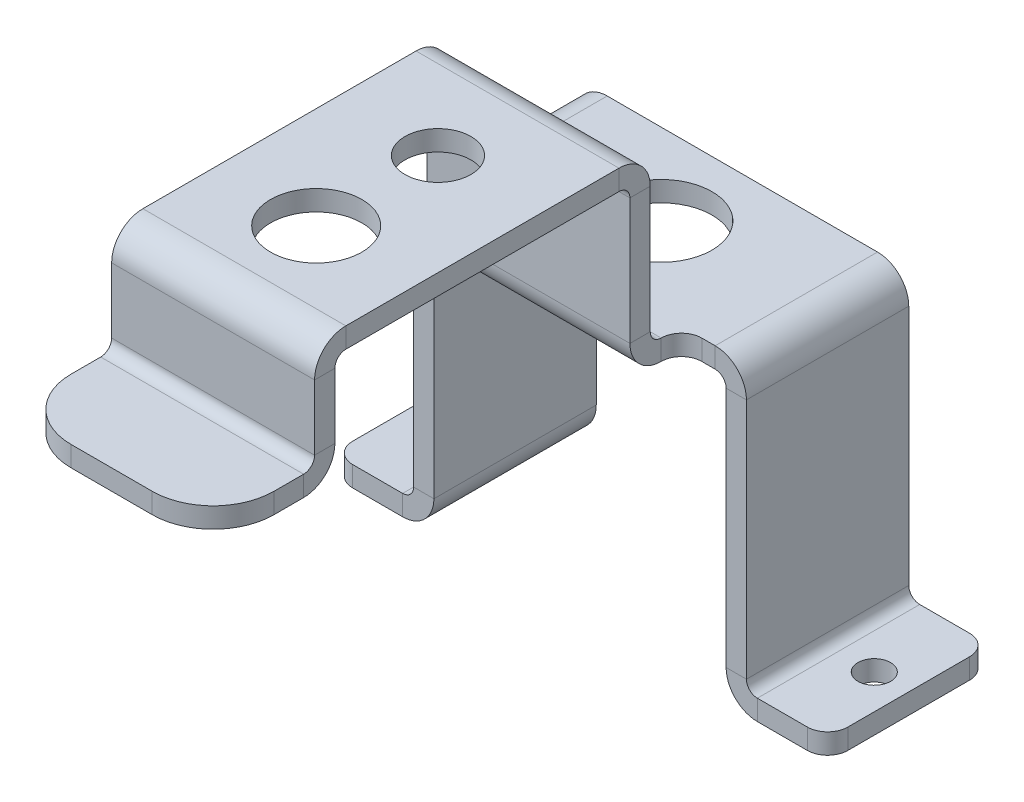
ISO-10303-21;
HEADER;
FILE_DESCRIPTION(('STEP AP214'),'2;1');
FILE_NAME('part.step','',(''),(''),'','','');
FILE_SCHEMA(('AUTOMOTIVE_DESIGN { 1 0 10303 214 1 1 1 1 }'));
ENDSEC;
DATA;
#1=APPLICATION_CONTEXT('core data for automotive mechanical design processes');
#2=APPLICATION_PROTOCOL_DEFINITION('international standard','automotive_design',2000,#1);
#3=PRODUCT_CONTEXT('',#1,'mechanical');
#4=PRODUCT('Part','Part','',(#3));
#5=PRODUCT_RELATED_PRODUCT_CATEGORY('part','',(#4));
#6=PRODUCT_DEFINITION_FORMATION('','',#4);
#7=PRODUCT_DEFINITION_CONTEXT('part definition',#1,'design');
#8=PRODUCT_DEFINITION('design','',#6,#7);
#9=PRODUCT_DEFINITION_SHAPE('','',#8);
#10=(LENGTH_UNIT() NAMED_UNIT(*) SI_UNIT(.MILLI.,.METRE.));
#11=(NAMED_UNIT(*) PLANE_ANGLE_UNIT() SI_UNIT($,.RADIAN.));
#12=(NAMED_UNIT(*) SI_UNIT($,.STERADIAN.) SOLID_ANGLE_UNIT());
#13=UNCERTAINTY_MEASURE_WITH_UNIT(LENGTH_MEASURE(1.E-05),#10,'distance_accuracy_value','');
#14=(GEOMETRIC_REPRESENTATION_CONTEXT(3) GLOBAL_UNCERTAINTY_ASSIGNED_CONTEXT((#13)) GLOBAL_UNIT_ASSIGNED_CONTEXT((#10,
#11,#12)) REPRESENTATION_CONTEXT('',''));
#15=CARTESIAN_POINT('',(0.,0.,0.));
#16=DIRECTION('',(0.,0.,1.));
#17=DIRECTION('',(1.,0.,0.));
#18=AXIS2_PLACEMENT_3D('',#15,#16,#17);
#19=CARTESIAN_POINT('',(-22.86,44.45,12.7));
#20=DIRECTION('',(0.,0.,1.));
#21=DIRECTION('',(1.,0.,0.));
#22=AXIS2_PLACEMENT_3D('',#19,#20,#21);
#23=PLANE('',#22);
#24=DIRECTION('',(-1.,0.,0.));
#25=VECTOR('',#24,1.);
#26=CARTESIAN_POINT('',(-22.86,47.625,12.7));
#27=LINE('',#26,#25);
#28=CARTESIAN_POINT('',(19.05,47.625,12.7));
#29=VERTEX_POINT('',#28);
#30=CARTESIAN_POINT('',(21.1455,47.625,12.7));
#31=VERTEX_POINT('',#30);
#32=EDGE_CURVE('E756',#29,#31,#27,.F.);
#33=ORIENTED_EDGE('',*,*,#32,.F.);
#34=DIRECTION('',(0.,1.,0.));
#35=VECTOR('',#34,1.);
#36=CARTESIAN_POINT('',(19.05,44.45,12.7));
#37=LINE('',#36,#35);
#38=CARTESIAN_POINT('',(19.05,44.45,12.7));
#39=VERTEX_POINT('',#38);
#40=EDGE_CURVE('E833',#29,#39,#37,.F.);
#41=ORIENTED_EDGE('',*,*,#40,.T.);
#42=DIRECTION('',(1.,0.,0.));
#43=VECTOR('',#42,1.);
#44=CARTESIAN_POINT('',(-22.86,44.45,12.7));
#45=LINE('',#44,#43);
#46=CARTESIAN_POINT('',(21.1455,44.45,12.7));
#47=VERTEX_POINT('',#46);
#48=EDGE_CURVE('E617',#39,#47,#45,.T.);
#49=ORIENTED_EDGE('',*,*,#48,.T.);
#50=DIRECTION('',(0.,-1.,0.));
#51=VECTOR('',#50,1.);
#52=CARTESIAN_POINT('',(21.1455,44.45,12.7));
#53=LINE('',#52,#51);
#54=EDGE_CURVE('E801',#31,#47,#53,.T.);
#55=ORIENTED_EDGE('',*,*,#54,.F.);
#56=EDGE_LOOP('',(#33,#41,#49,#55));
#57=FACE_BOUND('',#56,.T.);
#58=ADVANCED_FACE('F118',(#57),#23,.T.);
#59=CARTESIAN_POINT('',(-21.1455,44.45,12.7));
#60=VERTEX_POINT('',#59);
#61=CARTESIAN_POINT('',(-19.05,44.45,12.7));
#62=VERTEX_POINT('',#61);
#63=EDGE_CURVE('E619',#60,#62,#45,.T.);
#64=ORIENTED_EDGE('',*,*,#63,.T.);
#65=DIRECTION('',(0.,-1.,0.));
#66=VECTOR('',#65,1.);
#67=CARTESIAN_POINT('',(-19.05,44.45,12.7));
#68=LINE('',#67,#66);
#69=CARTESIAN_POINT('',(-19.05,47.625,12.7));
#70=VERTEX_POINT('',#69);
#71=EDGE_CURVE('E824',#62,#70,#68,.F.);
#72=ORIENTED_EDGE('',*,*,#71,.T.);
#73=CARTESIAN_POINT('',(-21.1455,47.625,12.7));
#74=VERTEX_POINT('',#73);
#75=EDGE_CURVE('E753',#74,#70,#27,.F.);
#76=ORIENTED_EDGE('',*,*,#75,.F.);
#77=DIRECTION('',(0.,-1.,0.));
#78=VECTOR('',#77,1.);
#79=CARTESIAN_POINT('',(-21.1455,44.45,12.7));
#80=LINE('',#79,#78);
#81=EDGE_CURVE('E799',#74,#60,#80,.T.);
#82=ORIENTED_EDGE('',*,*,#81,.T.);
#83=EDGE_LOOP('',(#64,#72,#76,#82));
#84=FACE_BOUND('',#83,.T.);
#85=ADVANCED_FACE('F942',(#84),#23,.T.);
#86=CARTESIAN_POINT('',(-22.86,0.,-12.7));
#87=DIRECTION('',(0.,0.,1.));
#88=DIRECTION('',(0.,1.,0.));
#89=AXIS2_PLACEMENT_3D('',#86,#87,#88);
#90=PLANE('',#89);
#91=DIRECTION('',(1.,0.,0.));
#92=VECTOR('',#91,1.);
#93=CARTESIAN_POINT('',(-22.86,4.8895,-12.7));
#94=LINE('',#93,#92);
#95=CARTESIAN_POINT('',(-26.035,4.8895,-12.7));
#96=VERTEX_POINT('',#95);
#97=CARTESIAN_POINT('',(-22.86,4.8895,-12.7));
#98=VERTEX_POINT('',#97);
#99=EDGE_CURVE('E822',#96,#98,#94,.T.);
#100=ORIENTED_EDGE('',*,*,#99,.F.);
#101=DIRECTION('',(0.,-1.,0.));
#102=VECTOR('',#101,1.);
#103=CARTESIAN_POINT('',(-26.035,0.,-12.7));
#104=LINE('',#103,#102);
#105=CARTESIAN_POINT('',(-26.035,42.7355,-12.7));
#106=VERTEX_POINT('',#105);
#107=EDGE_CURVE('E748',#96,#106,#104,.F.);
#108=ORIENTED_EDGE('',*,*,#107,.T.);
#109=DIRECTION('',(1.,0.,0.));
#110=VECTOR('',#109,1.);
#111=CARTESIAN_POINT('',(-22.86,42.7355,-12.7));
#112=LINE('',#111,#110);
#113=CARTESIAN_POINT('',(-22.86,42.7355,-12.7));
#114=VERTEX_POINT('',#113);
#115=EDGE_CURVE('E820',#106,#114,#112,.T.);
#116=ORIENTED_EDGE('',*,*,#115,.T.);
#117=DIRECTION('',(0.,1.,0.));
#118=VECTOR('',#117,1.);
#119=CARTESIAN_POINT('',(-22.86,0.,-12.7));
#120=LINE('',#119,#118);
#121=EDGE_CURVE('E622',#98,#114,#120,.T.);
#122=ORIENTED_EDGE('',*,*,#121,.F.);
#123=EDGE_LOOP('',(#100,#108,#116,#122));
#124=FACE_BOUND('',#123,.T.);
#125=ADVANCED_FACE('F1047',(#124),#90,.F.);
#126=CARTESIAN_POINT('',(-21.1455,42.7355,-12.7));
#127=DIRECTION('',(0.,0.,-1.));
#128=DIRECTION('',(-1.,0.,0.));
#129=AXIS2_PLACEMENT_3D('',#126,#127,#128);
#130=PLANE('',#129);
#131=ORIENTED_EDGE('',*,*,#115,.F.);
#132=CARTESIAN_POINT('',(-21.1455,42.7355,-12.7));
#133=DIRECTION('',(0.,0.,1.));
#134=DIRECTION('',(1.,0.,0.));
#135=AXIS2_PLACEMENT_3D('',#132,#133,#134);
#136=CIRCLE('',#135,4.8895);
#137=CARTESIAN_POINT('',(-21.1455,47.625,-12.7));
#138=VERTEX_POINT('',#137);
#139=EDGE_CURVE('E752',#106,#138,#136,.F.);
#140=ORIENTED_EDGE('',*,*,#139,.T.);
#141=DIRECTION('',(0.,-1.,0.));
#142=VECTOR('',#141,1.);
#143=CARTESIAN_POINT('',(-21.1455,44.45,-12.7));
#144=LINE('',#143,#142);
#145=CARTESIAN_POINT('',(-21.1455,44.45,-12.7));
#146=VERTEX_POINT('',#145);
#147=EDGE_CURVE('E818',#138,#146,#144,.T.);
#148=ORIENTED_EDGE('',*,*,#147,.T.);
#149=CARTESIAN_POINT('',(-21.1455,42.7355,-12.7));
#150=DIRECTION('',(0.,0.,1.));
#151=DIRECTION('',(1.,0.,0.));
#152=AXIS2_PLACEMENT_3D('',#149,#150,#151);
#153=CIRCLE('',#152,1.7145);
#154=EDGE_CURVE('E687',#114,#146,#153,.F.);
#155=ORIENTED_EDGE('',*,*,#154,.F.);
#156=EDGE_LOOP('',(#131,#140,#148,#155));
#157=FACE_BOUND('',#156,.T.);
#158=ADVANCED_FACE('F1091',(#157),#130,.T.);
#159=CARTESIAN_POINT('',(-22.86,44.45,-12.7));
#160=DIRECTION('',(0.,0.,1.));
#161=DIRECTION('',(1.,0.,0.));
#162=AXIS2_PLACEMENT_3D('',#159,#160,#161);
#163=PLANE('',#162);
#164=ORIENTED_EDGE('',*,*,#147,.F.);
#165=DIRECTION('',(-1.,0.,0.));
#166=VECTOR('',#165,1.);
#167=CARTESIAN_POINT('',(-22.86,47.625,-12.7));
#168=LINE('',#167,#166);
#169=CARTESIAN_POINT('',(21.1455,47.625,-12.7));
#170=VERTEX_POINT('',#169);
#171=EDGE_CURVE('E767',#138,#170,#168,.F.);
#172=ORIENTED_EDGE('',*,*,#171,.T.);
#173=DIRECTION('',(0.,-1.,0.));
#174=VECTOR('',#173,1.);
#175=CARTESIAN_POINT('',(21.1455,44.45,-12.7));
#176=LINE('',#175,#174);
#177=CARTESIAN_POINT('',(21.1455,44.45,-12.7));
#178=VERTEX_POINT('',#177);
#179=EDGE_CURVE('E816',#170,#178,#176,.T.);
#180=ORIENTED_EDGE('',*,*,#179,.T.);
#181=DIRECTION('',(1.,0.,0.));
#182=VECTOR('',#181,1.);
#183=CARTESIAN_POINT('',(-22.86,44.45,-12.7));
#184=LINE('',#183,#182);
#185=EDGE_CURVE('E614',#146,#178,#184,.T.);
#186=ORIENTED_EDGE('',*,*,#185,.F.);
#187=EDGE_LOOP('',(#164,#172,#180,#186));
#188=FACE_BOUND('',#187,.T.);
#189=ADVANCED_FACE('F1087',(#188),#163,.F.);
#190=CARTESIAN_POINT('',(21.1455,42.7355,-12.7));
#191=DIRECTION('',(0.,0.,-1.));
#192=DIRECTION('',(-1.,0.,0.));
#193=AXIS2_PLACEMENT_3D('',#190,#191,#192);
#194=PLANE('',#193);
#195=ORIENTED_EDGE('',*,*,#179,.F.);
#196=CARTESIAN_POINT('',(21.1455,42.7355,-12.7));
#197=DIRECTION('',(0.,0.,1.));
#198=DIRECTION('',(1.,0.,0.));
#199=AXIS2_PLACEMENT_3D('',#196,#197,#198);
#200=CIRCLE('',#199,4.8895);
#201=CARTESIAN_POINT('',(26.035,42.7355,-12.7));
#202=VERTEX_POINT('',#201);
#203=EDGE_CURVE('E613',#170,#202,#200,.F.);
#204=ORIENTED_EDGE('',*,*,#203,.T.);
#205=DIRECTION('',(-1.,0.,0.));
#206=VECTOR('',#205,1.);
#207=CARTESIAN_POINT('',(22.86,42.7355,-12.7));
#208=LINE('',#207,#206);
#209=CARTESIAN_POINT('',(22.86,42.7355,-12.7));
#210=VERTEX_POINT('',#209);
#211=EDGE_CURVE('E814',#202,#210,#208,.T.);
#212=ORIENTED_EDGE('',*,*,#211,.T.);
#213=CARTESIAN_POINT('',(21.1455,42.7355,-12.7));
#214=DIRECTION('',(0.,0.,1.));
#215=DIRECTION('',(1.,0.,0.));
#216=AXIS2_PLACEMENT_3D('',#213,#214,#215);
#217=CIRCLE('',#216,1.7145);
#218=EDGE_CURVE('E699',#178,#210,#217,.F.);
#219=ORIENTED_EDGE('',*,*,#218,.F.);
#220=EDGE_LOOP('',(#195,#204,#212,#219));
#221=FACE_BOUND('',#220,.T.);
#222=ADVANCED_FACE('F1083',(#221),#194,.T.);
#223=CARTESIAN_POINT('',(22.86,44.45,-12.7));
#224=DIRECTION('',(0.,0.,1.));
#225=DIRECTION('',(0.,-1.,0.));
#226=AXIS2_PLACEMENT_3D('',#223,#224,#225);
#227=PLANE('',#226);
#228=ORIENTED_EDGE('',*,*,#211,.F.);
#229=DIRECTION('',(0.,1.,0.));
#230=VECTOR('',#229,1.);
#231=CARTESIAN_POINT('',(26.035,44.45,-12.7));
#232=LINE('',#231,#230);
#233=CARTESIAN_POINT('',(26.035,4.88950000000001,-12.7));
#234=VERTEX_POINT('',#233);
#235=EDGE_CURVE('E747',#202,#234,#232,.F.);
#236=ORIENTED_EDGE('',*,*,#235,.T.);
#237=DIRECTION('',(-1.,0.,0.));
#238=VECTOR('',#237,1.);
#239=CARTESIAN_POINT('',(22.86,4.88950000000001,-12.7));
#240=LINE('',#239,#238);
#241=CARTESIAN_POINT('',(22.86,4.88950000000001,-12.7));
#242=VERTEX_POINT('',#241);
#243=EDGE_CURVE('E812',#234,#242,#240,.T.);
#244=ORIENTED_EDGE('',*,*,#243,.T.);
#245=DIRECTION('',(0.,-1.,0.));
#246=VECTOR('',#245,1.);
#247=CARTESIAN_POINT('',(22.86,44.45,-12.7));
#248=LINE('',#247,#246);
#249=EDGE_CURVE('E628',#210,#242,#248,.T.);
#250=ORIENTED_EDGE('',*,*,#249,.F.);
#251=EDGE_LOOP('',(#228,#236,#244,#250));
#252=FACE_BOUND('',#251,.T.);
#253=ADVANCED_FACE('F1079',(#252),#227,.F.);
#254=CARTESIAN_POINT('',(27.7495,4.88950000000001,-12.7));
#255=DIRECTION('',(0.,0.,1.));
#256=DIRECTION('',(1.,0.,0.));
#257=AXIS2_PLACEMENT_3D('',#254,#255,#256);
#258=PLANE('',#257);
#259=ORIENTED_EDGE('',*,*,#243,.F.);
#260=CARTESIAN_POINT('',(27.7495,4.88950000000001,-12.7));
#261=DIRECTION('',(0.,0.,-1.));
#262=DIRECTION('',(-1.,0.,0.));
#263=AXIS2_PLACEMENT_3D('',#260,#261,#262);
#264=CIRCLE('',#263,1.7145);
#265=CARTESIAN_POINT('',(27.7495,3.17500000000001,-12.7));
#266=VERTEX_POINT('',#265);
#267=EDGE_CURVE('E742',#234,#266,#264,.F.);
#268=ORIENTED_EDGE('',*,*,#267,.T.);
#269=DIRECTION('',(0.,-1.,0.));
#270=VECTOR('',#269,1.);
#271=CARTESIAN_POINT('',(27.7495,0.,-12.7));
#272=LINE('',#271,#270);
#273=CARTESIAN_POINT('',(27.7495,0.,-12.7));
#274=VERTEX_POINT('',#273);
#275=EDGE_CURVE('E810',#266,#274,#272,.T.);
#276=ORIENTED_EDGE('',*,*,#275,.T.);
#277=CARTESIAN_POINT('',(27.7495,4.88950000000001,-12.7));
#278=DIRECTION('',(0.,0.,-1.));
#279=DIRECTION('',(-1.,0.,0.));
#280=AXIS2_PLACEMENT_3D('',#277,#278,#279);
#281=CIRCLE('',#280,4.8895);
#282=EDGE_CURVE('E663',#242,#274,#281,.F.);
#283=ORIENTED_EDGE('',*,*,#282,.F.);
#284=EDGE_LOOP('',(#259,#268,#276,#283));
#285=FACE_BOUND('',#284,.T.);
#286=ADVANCED_FACE('F1075',(#285),#258,.F.);
#287=CARTESIAN_POINT('',(22.86,0.,-12.7));
#288=DIRECTION('',(0.,0.,1.));
#289=DIRECTION('',(1.,0.,0.));
#290=AXIS2_PLACEMENT_3D('',#287,#288,#289);
#291=PLANE('',#290);
#292=DIRECTION('',(-1.,0.,0.));
#293=VECTOR('',#292,1.);
#294=CARTESIAN_POINT('',(22.86,3.17500000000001,-12.7));
#295=LINE('',#294,#293);
#296=CARTESIAN_POINT('',(35.56,3.17500000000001,-12.7));
#297=VERTEX_POINT('',#296);
#298=EDGE_CURVE('E773',#266,#297,#295,.F.);
#299=ORIENTED_EDGE('',*,*,#298,.T.);
#300=DIRECTION('',(0.,-1.,0.));
#301=VECTOR('',#300,1.);
#302=CARTESIAN_POINT('',(35.56,0.,-12.7));
#303=LINE('',#302,#301);
#304=CARTESIAN_POINT('',(35.56,0.,-12.7));
#305=VERTEX_POINT('',#304);
#306=EDGE_CURVE('E875',#297,#305,#303,.T.);
#307=ORIENTED_EDGE('',*,*,#306,.T.);
#308=DIRECTION('',(1.,0.,0.));
#309=VECTOR('',#308,1.);
#310=CARTESIAN_POINT('',(22.86,0.,-12.7));
#311=LINE('',#310,#309);
#312=EDGE_CURVE('E637',#274,#305,#311,.T.);
#313=ORIENTED_EDGE('',*,*,#312,.F.);
#314=ORIENTED_EDGE('',*,*,#275,.F.);
#315=EDGE_LOOP('',(#299,#307,#313,#314));
#316=FACE_BOUND('',#315,.T.);
#317=ADVANCED_FACE('F1071',(#316),#291,.F.);
#318=CARTESIAN_POINT('',(38.735,0.,12.7));
#319=DIRECTION('',(1.,0.,0.));
#320=DIRECTION('',(0.,0.,-1.));
#321=AXIS2_PLACEMENT_3D('',#318,#319,#320);
#322=PLANE('',#321);
#323=DIRECTION('',(0.,0.,1.));
#324=VECTOR('',#323,1.);
#325=CARTESIAN_POINT('',(38.735,3.17500000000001,12.7));
#326=LINE('',#325,#324);
#327=CARTESIAN_POINT('',(38.735,3.17500000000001,9.52499999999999));
#328=VERTEX_POINT('',#327);
#329=CARTESIAN_POINT('',(38.735,3.17500000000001,-9.525));
#330=VERTEX_POINT('',#329);
#331=EDGE_CURVE('E770',#328,#330,#326,.F.);
#332=ORIENTED_EDGE('',*,*,#331,.F.);
#333=DIRECTION('',(0.,-1.,0.));
#334=VECTOR('',#333,1.);
#335=CARTESIAN_POINT('',(38.735,0.,9.52499999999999));
#336=LINE('',#335,#334);
#337=CARTESIAN_POINT('',(38.735,0.,9.52499999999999));
#338=VERTEX_POINT('',#337);
#339=EDGE_CURVE('E862',#328,#338,#336,.T.);
#340=ORIENTED_EDGE('',*,*,#339,.T.);
#341=DIRECTION('',(0.,0.,-1.));
#342=VECTOR('',#341,1.);
#343=CARTESIAN_POINT('',(38.735,0.,12.7));
#344=LINE('',#343,#342);
#345=CARTESIAN_POINT('',(38.735,0.,-9.525));
#346=VERTEX_POINT('',#345);
#347=EDGE_CURVE('E640',#338,#346,#344,.T.);
#348=ORIENTED_EDGE('',*,*,#347,.T.);
#349=DIRECTION('',(0.,1.,0.));
#350=VECTOR('',#349,1.);
#351=CARTESIAN_POINT('',(38.735,0.,-9.525));
#352=LINE('',#351,#350);
#353=EDGE_CURVE('E860',#346,#330,#352,.T.);
#354=ORIENTED_EDGE('',*,*,#353,.T.);
#355=EDGE_LOOP('',(#332,#340,#348,#354));
#356=FACE_BOUND('',#355,.T.);
#357=ADVANCED_FACE('F1067',(#356),#322,.T.);
#358=CARTESIAN_POINT('',(22.86,0.,12.7));
#359=DIRECTION('',(0.,0.,1.));
#360=DIRECTION('',(1.,0.,0.));
#361=AXIS2_PLACEMENT_3D('',#358,#359,#360);
#362=PLANE('',#361);
#363=DIRECTION('',(1.,0.,0.));
#364=VECTOR('',#363,1.);
#365=CARTESIAN_POINT('',(22.86,0.,12.7));
#366=LINE('',#365,#364);
#367=CARTESIAN_POINT('',(27.7495,0.,12.7));
#368=VERTEX_POINT('',#367);
#369=CARTESIAN_POINT('',(35.56,0.,12.7));
#370=VERTEX_POINT('',#369);
#371=EDGE_CURVE('E643',#368,#370,#366,.T.);
#372=ORIENTED_EDGE('',*,*,#371,.T.);
#373=DIRECTION('',(0.,-1.,0.));
#374=VECTOR('',#373,1.);
#375=CARTESIAN_POINT('',(35.56,0.,12.7));
#376=LINE('',#375,#374);
#377=CARTESIAN_POINT('',(35.56,3.17500000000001,12.7));
#378=VERTEX_POINT('',#377);
#379=EDGE_CURVE('E869',#370,#378,#376,.F.);
#380=ORIENTED_EDGE('',*,*,#379,.T.);
#381=DIRECTION('',(-1.,0.,0.));
#382=VECTOR('',#381,1.);
#383=CARTESIAN_POINT('',(22.86,3.17500000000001,12.7));
#384=LINE('',#383,#382);
#385=CARTESIAN_POINT('',(27.7495,3.17500000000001,12.7));
#386=VERTEX_POINT('',#385);
#387=EDGE_CURVE('E733',#386,#378,#384,.F.);
#388=ORIENTED_EDGE('',*,*,#387,.F.);
#389=DIRECTION('',(0.,-1.,0.));
#390=VECTOR('',#389,1.);
#391=CARTESIAN_POINT('',(27.7495,0.,12.7));
#392=LINE('',#391,#390);
#393=EDGE_CURVE('E808',#386,#368,#392,.T.);
#394=ORIENTED_EDGE('',*,*,#393,.T.);
#395=EDGE_LOOP('',(#372,#380,#388,#394));
#396=FACE_BOUND('',#395,.T.);
#397=ADVANCED_FACE('F1063',(#396),#362,.T.);
#398=CARTESIAN_POINT('',(27.7495,4.88950000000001,12.7));
#399=DIRECTION('',(0.,0.,-1.));
#400=DIRECTION('',(-1.,0.,0.));
#401=AXIS2_PLACEMENT_3D('',#398,#399,#400);
#402=PLANE('',#401);
#403=ORIENTED_EDGE('',*,*,#393,.F.);
#404=CARTESIAN_POINT('',(27.7495,4.88950000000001,12.7));
#405=DIRECTION('',(0.,0.,-1.));
#406=DIRECTION('',(-1.,0.,0.));
#407=AXIS2_PLACEMENT_3D('',#404,#405,#406);
#408=CIRCLE('',#407,1.7145);
#409=CARTESIAN_POINT('',(26.035,4.88950000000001,12.7));
#410=VERTEX_POINT('',#409);
#411=EDGE_CURVE('E764',#386,#410,#408,.T.);
#412=ORIENTED_EDGE('',*,*,#411,.T.);
#413=DIRECTION('',(-1.,0.,0.));
#414=VECTOR('',#413,1.);
#415=CARTESIAN_POINT('',(22.86,4.88950000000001,12.7));
#416=LINE('',#415,#414);
#417=CARTESIAN_POINT('',(22.86,4.88950000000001,12.7));
#418=VERTEX_POINT('',#417);
#419=EDGE_CURVE('E806',#410,#418,#416,.T.);
#420=ORIENTED_EDGE('',*,*,#419,.T.);
#421=CARTESIAN_POINT('',(27.7495,4.88950000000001,12.7));
#422=DIRECTION('',(0.,0.,1.));
#423=DIRECTION('',(1.,0.,0.));
#424=AXIS2_PLACEMENT_3D('',#421,#422,#423);
#425=CIRCLE('',#424,4.8895);
#426=EDGE_CURVE('E618',#368,#418,#425,.F.);
#427=ORIENTED_EDGE('',*,*,#426,.F.);
#428=EDGE_LOOP('',(#403,#412,#420,#427));
#429=FACE_BOUND('',#428,.T.);
#430=ADVANCED_FACE('F1059',(#429),#402,.F.);
#431=CARTESIAN_POINT('',(22.86,44.45,12.7));
#432=DIRECTION('',(0.,0.,1.));
#433=DIRECTION('',(0.,-1.,0.));
#434=AXIS2_PLACEMENT_3D('',#431,#432,#433);
#435=PLANE('',#434);
#436=ORIENTED_EDGE('',*,*,#419,.F.);
#437=DIRECTION('',(0.,1.,0.));
#438=VECTOR('',#437,1.);
#439=CARTESIAN_POINT('',(26.035,44.45,12.7));
#440=LINE('',#439,#438);
#441=CARTESIAN_POINT('',(26.035,42.7355,12.7));
#442=VERTEX_POINT('',#441);
#443=EDGE_CURVE('E760',#442,#410,#440,.F.);
#444=ORIENTED_EDGE('',*,*,#443,.F.);
#445=DIRECTION('',(-1.,0.,0.));
#446=VECTOR('',#445,1.);
#447=CARTESIAN_POINT('',(22.86,42.7355,12.7));
#448=LINE('',#447,#446);
#449=CARTESIAN_POINT('',(22.86,42.7355,12.7));
#450=VERTEX_POINT('',#449);
#451=EDGE_CURVE('E804',#442,#450,#448,.T.);
#452=ORIENTED_EDGE('',*,*,#451,.T.);
#453=DIRECTION('',(0.,-1.,0.));
#454=VECTOR('',#453,1.);
#455=CARTESIAN_POINT('',(22.86,44.45,12.7));
#456=LINE('',#455,#454);
#457=EDGE_CURVE('E631',#450,#418,#456,.T.);
#458=ORIENTED_EDGE('',*,*,#457,.T.);
#459=EDGE_LOOP('',(#436,#444,#452,#458));
#460=FACE_BOUND('',#459,.T.);
#461=ADVANCED_FACE('F1055',(#460),#435,.T.);
#462=CARTESIAN_POINT('',(21.1455,42.7355,12.7));
#463=DIRECTION('',(0.,0.,1.));
#464=DIRECTION('',(1.,0.,0.));
#465=AXIS2_PLACEMENT_3D('',#462,#463,#464);
#466=PLANE('',#465);
#467=ORIENTED_EDGE('',*,*,#451,.F.);
#468=CARTESIAN_POINT('',(21.1455,42.7355,12.7));
#469=DIRECTION('',(0.,0.,1.));
#470=DIRECTION('',(1.,0.,0.));
#471=AXIS2_PLACEMENT_3D('',#468,#469,#470);
#472=CIRCLE('',#471,4.8895);
#473=EDGE_CURVE('E757',#442,#31,#472,.T.);
#474=ORIENTED_EDGE('',*,*,#473,.T.);
#475=ORIENTED_EDGE('',*,*,#54,.T.);
#476=CARTESIAN_POINT('',(21.1455,42.7355,12.7));
#477=DIRECTION('',(0.,0.,-1.));
#478=DIRECTION('',(-1.,0.,0.));
#479=AXIS2_PLACEMENT_3D('',#476,#477,#478);
#480=CIRCLE('',#479,1.7145);
#481=EDGE_CURVE('E690',#450,#47,#480,.F.);
#482=ORIENTED_EDGE('',*,*,#481,.F.);
#483=EDGE_LOOP('',(#467,#474,#475,#482));
#484=FACE_BOUND('',#483,.T.);
#485=ADVANCED_FACE('F1052',(#484),#466,.T.);
#486=CARTESIAN_POINT('',(-21.1455,42.7355,12.7));
#487=DIRECTION('',(0.,0.,1.));
#488=DIRECTION('',(1.,0.,0.));
#489=AXIS2_PLACEMENT_3D('',#486,#487,#488);
#490=PLANE('',#489);
#491=ORIENTED_EDGE('',*,*,#81,.F.);
#492=CARTESIAN_POINT('',(-21.1455,42.7355,12.7));
#493=DIRECTION('',(0.,0.,1.));
#494=DIRECTION('',(1.,0.,0.));
#495=AXIS2_PLACEMENT_3D('',#492,#493,#494);
#496=CIRCLE('',#495,4.8895);
#497=CARTESIAN_POINT('',(-26.035,42.7355,12.7));
#498=VERTEX_POINT('',#497);
#499=EDGE_CURVE('E749',#74,#498,#496,.T.);
#500=ORIENTED_EDGE('',*,*,#499,.T.);
#501=DIRECTION('',(1.,0.,0.));
#502=VECTOR('',#501,1.);
#503=CARTESIAN_POINT('',(-22.86,42.7355,12.7));
#504=LINE('',#503,#502);
#505=CARTESIAN_POINT('',(-22.86,42.7355,12.7));
#506=VERTEX_POINT('',#505);
#507=EDGE_CURVE('E797',#498,#506,#504,.T.);
#508=ORIENTED_EDGE('',*,*,#507,.T.);
#509=CARTESIAN_POINT('',(-21.1455,42.7355,12.7));
#510=DIRECTION('',(0.,0.,-1.));
#511=DIRECTION('',(-1.,0.,0.));
#512=AXIS2_PLACEMENT_3D('',#509,#510,#511);
#513=CIRCLE('',#512,1.7145);
#514=EDGE_CURVE('E678',#60,#506,#513,.F.);
#515=ORIENTED_EDGE('',*,*,#514,.F.);
#516=EDGE_LOOP('',(#491,#500,#508,#515));
#517=FACE_BOUND('',#516,.T.);
#518=ADVANCED_FACE('F934',(#517),#490,.T.);
#519=CARTESIAN_POINT('',(-22.86,0.,12.7));
#520=DIRECTION('',(0.,0.,1.));
#521=DIRECTION('',(0.,1.,0.));
#522=AXIS2_PLACEMENT_3D('',#519,#520,#521);
#523=PLANE('',#522);
#524=ORIENTED_EDGE('',*,*,#507,.F.);
#525=DIRECTION('',(0.,-1.,0.));
#526=VECTOR('',#525,1.);
#527=CARTESIAN_POINT('',(-26.035,0.,12.7));
#528=LINE('',#527,#526);
#529=CARTESIAN_POINT('',(-26.035,4.8895,12.7));
#530=VERTEX_POINT('',#529);
#531=EDGE_CURVE('E744',#530,#498,#528,.F.);
#532=ORIENTED_EDGE('',*,*,#531,.F.);
#533=DIRECTION('',(1.,0.,0.));
#534=VECTOR('',#533,1.);
#535=CARTESIAN_POINT('',(-22.86,4.8895,12.7));
#536=LINE('',#535,#534);
#537=CARTESIAN_POINT('',(-22.86,4.8895,12.7));
#538=VERTEX_POINT('',#537);
#539=EDGE_CURVE('E795',#530,#538,#536,.T.);
#540=ORIENTED_EDGE('',*,*,#539,.T.);
#541=DIRECTION('',(0.,1.,0.));
#542=VECTOR('',#541,1.);
#543=CARTESIAN_POINT('',(-22.86,0.,12.7));
#544=LINE('',#543,#542);
#545=EDGE_CURVE('E625',#538,#506,#544,.T.);
#546=ORIENTED_EDGE('',*,*,#545,.T.);
#547=EDGE_LOOP('',(#524,#532,#540,#546));
#548=FACE_BOUND('',#547,.T.);
#549=ADVANCED_FACE('F926',(#548),#523,.T.);
#550=CARTESIAN_POINT('',(-27.7495,4.8895,12.7));
#551=DIRECTION('',(0.,0.,-1.));
#552=DIRECTION('',(-1.,0.,0.));
#553=AXIS2_PLACEMENT_3D('',#550,#551,#552);
#554=PLANE('',#553);
#555=ORIENTED_EDGE('',*,*,#539,.F.);
#556=CARTESIAN_POINT('',(-27.7495,4.8895,12.7));
#557=DIRECTION('',(0.,0.,-1.));
#558=DIRECTION('',(-1.,0.,0.));
#559=AXIS2_PLACEMENT_3D('',#556,#557,#558);
#560=CIRCLE('',#559,1.7145);
#561=CARTESIAN_POINT('',(-27.7495,3.175,12.7));
#562=VERTEX_POINT('',#561);
#563=EDGE_CURVE('E739',#530,#562,#560,.T.);
#564=ORIENTED_EDGE('',*,*,#563,.T.);
#565=DIRECTION('',(0.,-1.,0.));
#566=VECTOR('',#565,1.);
#567=CARTESIAN_POINT('',(-27.7495,0.,12.7));
#568=LINE('',#567,#566);
#569=CARTESIAN_POINT('',(-27.7495,0.,12.7));
#570=VERTEX_POINT('',#569);
#571=EDGE_CURVE('E792',#562,#570,#568,.T.);
#572=ORIENTED_EDGE('',*,*,#571,.T.);
#573=CARTESIAN_POINT('',(-27.7495,4.8895,12.7));
#574=DIRECTION('',(0.,0.,1.));
#575=DIRECTION('',(1.,0.,0.));
#576=AXIS2_PLACEMENT_3D('',#573,#574,#575);
#577=CIRCLE('',#576,4.8895);
#578=EDGE_CURVE('E666',#538,#570,#577,.F.);
#579=ORIENTED_EDGE('',*,*,#578,.F.);
#580=EDGE_LOOP('',(#555,#564,#572,#579));
#581=FACE_BOUND('',#580,.T.);
#582=ADVANCED_FACE('F917',(#581),#554,.F.);
#583=CARTESIAN_POINT('',(-38.735,0.,12.7));
#584=DIRECTION('',(0.,0.,1.));
#585=DIRECTION('',(1.,0.,0.));
#586=AXIS2_PLACEMENT_3D('',#583,#584,#585);
#587=PLANE('',#586);
#588=DIRECTION('',(1.,0.,0.));
#589=VECTOR('',#588,1.);
#590=CARTESIAN_POINT('',(-38.735,3.175,12.7));
#591=LINE('',#590,#589);
#592=CARTESIAN_POINT('',(-35.56,3.175,12.7));
#593=VERTEX_POINT('',#592);
#594=EDGE_CURVE('E735',#593,#562,#591,.T.);
#595=ORIENTED_EDGE('',*,*,#594,.F.);
#596=DIRECTION('',(0.,1.,0.));
#597=VECTOR('',#596,1.);
#598=CARTESIAN_POINT('',(-35.56,0.,12.7));
#599=LINE('',#598,#597);
#600=CARTESIAN_POINT('',(-35.56,0.,12.7));
#601=VERTEX_POINT('',#600);
#602=EDGE_CURVE('E13',#593,#601,#599,.F.);
#603=ORIENTED_EDGE('',*,*,#602,.T.);
#604=DIRECTION('',(1.,0.,0.));
#605=VECTOR('',#604,1.);
#606=CARTESIAN_POINT('',(-38.735,0.,12.7));
#607=LINE('',#606,#605);
#608=EDGE_CURVE('E651',#601,#570,#607,.T.);
#609=ORIENTED_EDGE('',*,*,#608,.T.);
#610=ORIENTED_EDGE('',*,*,#571,.F.);
#611=EDGE_LOOP('',(#595,#603,#609,#610));
#612=FACE_BOUND('',#611,.T.);
#613=ADVANCED_FACE('F914',(#612),#587,.T.);
#614=CARTESIAN_POINT('',(-38.735,0.,12.7));
#615=DIRECTION('',(1.,0.,0.));
#616=DIRECTION('',(0.,0.,-1.));
#617=AXIS2_PLACEMENT_3D('',#614,#615,#616);
#618=PLANE('',#617);
#619=DIRECTION('',(0.,0.,1.));
#620=VECTOR('',#619,1.);
#621=CARTESIAN_POINT('',(-38.735,3.175,12.7));
#622=LINE('',#621,#620);
#623=CARTESIAN_POINT('',(-38.735,3.175,9.52499999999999));
#624=VERTEX_POINT('',#623);
#625=CARTESIAN_POINT('',(-38.735,3.175,-9.525));
#626=VERTEX_POINT('',#625);
#627=EDGE_CURVE('E728',#624,#626,#622,.F.);
#628=ORIENTED_EDGE('',*,*,#627,.T.);
#629=DIRECTION('',(0.,1.,0.));
#630=VECTOR('',#629,1.);
#631=CARTESIAN_POINT('',(-38.735,0.,-9.525));
#632=LINE('',#631,#630);
#633=CARTESIAN_POINT('',(-38.735,0.,-9.525));
#634=VERTEX_POINT('',#633);
#635=EDGE_CURVE('E880',#626,#634,#632,.F.);
#636=ORIENTED_EDGE('',*,*,#635,.T.);
#637=DIRECTION('',(0.,0.,-1.));
#638=VECTOR('',#637,1.);
#639=CARTESIAN_POINT('',(-38.735,0.,12.7));
#640=LINE('',#639,#638);
#641=CARTESIAN_POINT('',(-38.735,0.,9.52499999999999));
#642=VERTEX_POINT('',#641);
#643=EDGE_CURVE('E653',#642,#634,#640,.T.);
#644=ORIENTED_EDGE('',*,*,#643,.F.);
#645=DIRECTION('',(0.,-1.,0.));
#646=VECTOR('',#645,1.);
#647=CARTESIAN_POINT('',(-38.735,0.,9.52499999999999));
#648=LINE('',#647,#646);
#649=EDGE_CURVE('E878',#642,#624,#648,.F.);
#650=ORIENTED_EDGE('',*,*,#649,.T.);
#651=EDGE_LOOP('',(#628,#636,#644,#650));
#652=FACE_BOUND('',#651,.T.);
#653=ADVANCED_FACE('F894',(#652),#618,.F.);
#654=CARTESIAN_POINT('',(-38.735,0.,-12.7));
#655=DIRECTION('',(0.,0.,1.));
#656=DIRECTION('',(1.,0.,0.));
#657=AXIS2_PLACEMENT_3D('',#654,#655,#656);
#658=PLANE('',#657);
#659=DIRECTION('',(1.,0.,0.));
#660=VECTOR('',#659,1.);
#661=CARTESIAN_POINT('',(-38.735,0.,-12.7));
#662=LINE('',#661,#660);
#663=CARTESIAN_POINT('',(-35.56,0.,-12.7));
#664=VERTEX_POINT('',#663);
#665=CARTESIAN_POINT('',(-27.7495,0.,-12.7));
#666=VERTEX_POINT('',#665);
#667=EDGE_CURVE('E649',#664,#666,#662,.T.);
#668=ORIENTED_EDGE('',*,*,#667,.F.);
#669=DIRECTION('',(0.,1.,0.));
#670=VECTOR('',#669,1.);
#671=CARTESIAN_POINT('',(-35.56,0.,-12.7));
#672=LINE('',#671,#670);
#673=CARTESIAN_POINT('',(-35.56,3.175,-12.7));
#674=VERTEX_POINT('',#673);
#675=EDGE_CURVE('E141',#664,#674,#672,.T.);
#676=ORIENTED_EDGE('',*,*,#675,.T.);
#677=DIRECTION('',(1.,0.,0.));
#678=VECTOR('',#677,1.);
#679=CARTESIAN_POINT('',(-38.735,3.175,-12.7));
#680=LINE('',#679,#678);
#681=CARTESIAN_POINT('',(-27.7495,3.175,-12.7));
#682=VERTEX_POINT('',#681);
#683=EDGE_CURVE('E732',#674,#682,#680,.T.);
#684=ORIENTED_EDGE('',*,*,#683,.T.);
#685=DIRECTION('',(0.,-1.,0.));
#686=VECTOR('',#685,1.);
#687=CARTESIAN_POINT('',(-27.7495,0.,-12.7));
#688=LINE('',#687,#686);
#689=EDGE_CURVE('E698',#682,#666,#688,.T.);
#690=ORIENTED_EDGE('',*,*,#689,.T.);
#691=EDGE_LOOP('',(#668,#676,#684,#690));
#692=FACE_BOUND('',#691,.T.);
#693=ADVANCED_FACE('F900',(#692),#658,.F.);
#694=CARTESIAN_POINT('',(33.3375,0.,0.));
#695=DIRECTION('',(0.,1.,0.));
#696=DIRECTION('',(0.,0.,1.));
#697=AXIS2_PLACEMENT_3D('',#694,#695,#696);
#698=CYLINDRICAL_SURFACE('',#697,2.5527);
#699=CARTESIAN_POINT('',(33.3375,0.,0.));
#700=DIRECTION('',(0.,1.,0.));
#701=DIRECTION('',(0.,0.,1.));
#702=AXIS2_PLACEMENT_3D('',#699,#700,#701);
#703=CIRCLE('',#702,2.5527);
#704=CARTESIAN_POINT('',(33.3375,0.,2.5527));
#705=VERTEX_POINT('',#704);
#706=EDGE_CURVE('E634',#705,#705,#703,.T.);
#707=ORIENTED_EDGE('',*,*,#706,.F.);
#708=EDGE_LOOP('',(#707));
#709=FACE_BOUND('',#708,.T.);
#710=CARTESIAN_POINT('',(33.3375,3.175,0.));
#711=DIRECTION('',(0.,1.,0.));
#712=DIRECTION('',(0.,0.,1.));
#713=AXIS2_PLACEMENT_3D('',#710,#711,#712);
#714=CIRCLE('',#713,2.5527);
#715=CARTESIAN_POINT('',(33.3375,3.175,2.5527));
#716=VERTEX_POINT('',#715);
#717=EDGE_CURVE('E763',#716,#716,#714,.T.);
#718=ORIENTED_EDGE('',*,*,#717,.T.);
#719=EDGE_LOOP('',(#718));
#720=FACE_BOUND('',#719,.T.);
#721=ADVANCED_FACE('F1102',(#709,#720),#698,.F.);
#722=CARTESIAN_POINT('',(-33.3375,0.,0.));
#723=DIRECTION('',(0.,1.,0.));
#724=DIRECTION('',(0.,0.,1.));
#725=AXIS2_PLACEMENT_3D('',#722,#723,#724);
#726=CYLINDRICAL_SURFACE('',#725,2.5527);
#727=CARTESIAN_POINT('',(-33.3375,0.,0.));
#728=DIRECTION('',(0.,1.,0.));
#729=DIRECTION('',(0.,0.,1.));
#730=AXIS2_PLACEMENT_3D('',#727,#728,#729);
#731=CIRCLE('',#730,2.5527);
#732=CARTESIAN_POINT('',(-33.3375,0.,2.5527));
#733=VERTEX_POINT('',#732);
#734=EDGE_CURVE('E646',#733,#733,#731,.T.);
#735=ORIENTED_EDGE('',*,*,#734,.F.);
#736=EDGE_LOOP('',(#735));
#737=FACE_BOUND('',#736,.T.);
#738=CARTESIAN_POINT('',(-33.3375,3.175,0.));
#739=DIRECTION('',(0.,1.,0.));
#740=DIRECTION('',(0.,0.,1.));
#741=AXIS2_PLACEMENT_3D('',#738,#739,#740);
#742=CIRCLE('',#741,2.5527);
#743=CARTESIAN_POINT('',(-33.3375,3.175,2.5527));
#744=VERTEX_POINT('',#743);
#745=EDGE_CURVE('E729',#744,#744,#742,.T.);
#746=ORIENTED_EDGE('',*,*,#745,.T.);
#747=EDGE_LOOP('',(#746));
#748=FACE_BOUND('',#747,.T.);
#749=ADVANCED_FACE('F1101',(#737,#748),#726,.F.);
#750=CARTESIAN_POINT('',(-27.7495,4.8895,-12.7));
#751=DIRECTION('',(0.,0.,1.));
#752=DIRECTION('',(1.,0.,0.));
#753=AXIS2_PLACEMENT_3D('',#750,#751,#752);
#754=PLANE('',#753);
#755=CARTESIAN_POINT('',(-27.7495,4.8895,-12.7));
#756=DIRECTION('',(0.,0.,-1.));
#757=DIRECTION('',(-1.,0.,0.));
#758=AXIS2_PLACEMENT_3D('',#755,#756,#757);
#759=CIRCLE('',#758,1.7145);
#760=EDGE_CURVE('E743',#682,#96,#759,.F.);
#761=ORIENTED_EDGE('',*,*,#760,.T.);
#762=ORIENTED_EDGE('',*,*,#99,.T.);
#763=CARTESIAN_POINT('',(-27.7495,4.8895,-12.7));
#764=DIRECTION('',(0.,0.,-1.));
#765=DIRECTION('',(-1.,0.,0.));
#766=AXIS2_PLACEMENT_3D('',#763,#764,#765);
#767=CIRCLE('',#766,4.8895);
#768=EDGE_CURVE('E675',#666,#98,#767,.F.);
#769=ORIENTED_EDGE('',*,*,#768,.F.);
#770=ORIENTED_EDGE('',*,*,#689,.F.);
#771=EDGE_LOOP('',(#761,#762,#769,#770));
#772=FACE_BOUND('',#771,.T.);
#773=ADVANCED_FACE('F905',(#772),#754,.F.);
#774=CARTESIAN_POINT('',(-38.735,0.,12.7));
#775=DIRECTION('',(0.,1.,0.));
#776=DIRECTION('',(0.,0.,1.));
#777=AXIS2_PLACEMENT_3D('',#774,#775,#776);
#778=PLANE('',#777);
#779=ORIENTED_EDGE('',*,*,#734,.T.);
#780=EDGE_LOOP('',(#779));
#781=FACE_BOUND('',#780,.T.);
#782=ORIENTED_EDGE('',*,*,#643,.T.);
#783=CARTESIAN_POINT('',(-35.56,0.,-9.525));
#784=DIRECTION('',(0.,1.,0.));
#785=DIRECTION('',(0.,0.,1.));
#786=AXIS2_PLACEMENT_3D('',#783,#784,#785);
#787=CIRCLE('',#786,3.175);
#788=EDGE_CURVE('E885',#634,#664,#787,.F.);
#789=ORIENTED_EDGE('',*,*,#788,.T.);
#790=ORIENTED_EDGE('',*,*,#667,.T.);
#791=DIRECTION('',(0.,0.,-1.));
#792=VECTOR('',#791,1.);
#793=CARTESIAN_POINT('',(-27.7495,0.,12.7));
#794=LINE('',#793,#792);
#795=EDGE_CURVE('E671',#666,#570,#794,.F.);
#796=ORIENTED_EDGE('',*,*,#795,.T.);
#797=ORIENTED_EDGE('',*,*,#608,.F.);
#798=CARTESIAN_POINT('',(-35.56,0.,9.52499999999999));
#799=DIRECTION('',(0.,1.,0.));
#800=DIRECTION('',(0.,0.,1.));
#801=AXIS2_PLACEMENT_3D('',#798,#799,#800);
#802=CIRCLE('',#801,3.175);
#803=EDGE_CURVE('E883',#601,#642,#802,.F.);
#804=ORIENTED_EDGE('',*,*,#803,.T.);
#805=EDGE_LOOP('',(#782,#789,#790,#796,#797,#804));
#806=FACE_BOUND('',#805,.T.);
#807=ADVANCED_FACE('F899',(#781,#806),#778,.F.);
#808=CARTESIAN_POINT('',(22.86,0.,12.7));
#809=DIRECTION('',(0.,1.,0.));
#810=DIRECTION('',(-1.,0.,0.));
#811=AXIS2_PLACEMENT_3D('',#808,#809,#810);
#812=PLANE('',#811);
#813=ORIENTED_EDGE('',*,*,#706,.T.);
#814=EDGE_LOOP('',(#813));
#815=FACE_BOUND('',#814,.T.);
#816=ORIENTED_EDGE('',*,*,#347,.F.);
#817=CARTESIAN_POINT('',(35.56,0.,9.52499999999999));
#818=DIRECTION('',(0.,1.,0.));
#819=DIRECTION('',(-1.,0.,0.));
#820=AXIS2_PLACEMENT_3D('',#817,#818,#819);
#821=CIRCLE('',#820,3.175);
#822=EDGE_CURVE('E867',#338,#370,#821,.F.);
#823=ORIENTED_EDGE('',*,*,#822,.T.);
#824=ORIENTED_EDGE('',*,*,#371,.F.);
#825=DIRECTION('',(0.,0.,-1.));
#826=VECTOR('',#825,1.);
#827=CARTESIAN_POINT('',(27.7495,0.,12.7));
#828=LINE('',#827,#826);
#829=EDGE_CURVE('E656',#368,#274,#828,.T.);
#830=ORIENTED_EDGE('',*,*,#829,.T.);
#831=ORIENTED_EDGE('',*,*,#312,.T.);
#832=CARTESIAN_POINT('',(35.56,0.,-9.52499999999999));
#833=DIRECTION('',(0.,1.,0.));
#834=DIRECTION('',(-1.,0.,0.));
#835=AXIS2_PLACEMENT_3D('',#832,#833,#834);
#836=CIRCLE('',#835,3.175);
#837=EDGE_CURVE('E865',#305,#346,#836,.F.);
#838=ORIENTED_EDGE('',*,*,#837,.T.);
#839=EDGE_LOOP('',(#816,#823,#824,#830,#831,#838));
#840=FACE_BOUND('',#839,.T.);
#841=ADVANCED_FACE('F1241',(#815,#840),#812,.F.);
#842=CARTESIAN_POINT('',(22.86,44.45,12.7));
#843=DIRECTION('',(1.,0.,0.));
#844=DIRECTION('',(0.,1.,0.));
#845=AXIS2_PLACEMENT_3D('',#842,#843,#844);
#846=PLANE('',#845);
#847=ORIENTED_EDGE('',*,*,#457,.F.);
#848=DIRECTION('',(0.,0.,-1.));
#849=VECTOR('',#848,1.);
#850=CARTESIAN_POINT('',(22.86,42.7355,-12.7));
#851=LINE('',#850,#849);
#852=EDGE_CURVE('E686',#450,#210,#851,.T.);
#853=ORIENTED_EDGE('',*,*,#852,.T.);
#854=ORIENTED_EDGE('',*,*,#249,.T.);
#855=DIRECTION('',(0.,0.,-1.));
#856=VECTOR('',#855,1.);
#857=CARTESIAN_POINT('',(22.86,4.88950000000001,12.7));
#858=LINE('',#857,#856);
#859=EDGE_CURVE('E659',#242,#418,#858,.F.);
#860=ORIENTED_EDGE('',*,*,#859,.T.);
#861=EDGE_LOOP('',(#847,#853,#854,#860));
#862=FACE_BOUND('',#861,.T.);
#863=ADVANCED_FACE('F1130',(#862),#846,.F.);
#864=CARTESIAN_POINT('',(-22.86,0.,12.7));
#865=DIRECTION('',(-1.,0.,0.));
#866=DIRECTION('',(0.,-1.,0.));
#867=AXIS2_PLACEMENT_3D('',#864,#865,#866);
#868=PLANE('',#867);
#869=ORIENTED_EDGE('',*,*,#121,.T.);
#870=DIRECTION('',(0.,0.,-1.));
#871=VECTOR('',#870,1.);
#872=CARTESIAN_POINT('',(-22.86,42.7355,12.7));
#873=LINE('',#872,#871);
#874=EDGE_CURVE('E683',#114,#506,#873,.F.);
#875=ORIENTED_EDGE('',*,*,#874,.T.);
#876=ORIENTED_EDGE('',*,*,#545,.F.);
#877=DIRECTION('',(0.,0.,-1.));
#878=VECTOR('',#877,1.);
#879=CARTESIAN_POINT('',(-22.86,4.8895,12.7));
#880=LINE('',#879,#878);
#881=EDGE_CURVE('E662',#538,#98,#880,.T.);
#882=ORIENTED_EDGE('',*,*,#881,.T.);
#883=EDGE_LOOP('',(#869,#875,#876,#882));
#884=FACE_BOUND('',#883,.T.);
#885=ADVANCED_FACE('F1234',(#884),#868,.F.);
#886=CARTESIAN_POINT('',(-22.86,44.45,12.7));
#887=DIRECTION('',(0.,1.,0.));
#888=DIRECTION('',(-1.,0.,0.));
#889=AXIS2_PLACEMENT_3D('',#886,#887,#888);
#890=PLANE('',#889);
#891=CARTESIAN_POINT('',(0.,44.45,0.));
#892=DIRECTION('',(0.,-1.,0.));
#893=DIRECTION('',(1.,0.,0.));
#894=AXIS2_PLACEMENT_3D('',#891,#892,#893);
#895=CIRCLE('',#894,7.9375);
#896=CARTESIAN_POINT('',(7.93749999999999,44.45,0.));
#897=VERTEX_POINT('',#896);
#898=EDGE_CURVE('E831',#897,#897,#895,.T.);
#899=ORIENTED_EDGE('',*,*,#898,.F.);
#900=EDGE_LOOP('',(#899));
#901=FACE_BOUND('',#900,.T.);
#902=ORIENTED_EDGE('',*,*,#185,.T.);
#903=DIRECTION('',(0.,0.,-1.));
#904=VECTOR('',#903,1.);
#905=CARTESIAN_POINT('',(21.1455,44.45,12.7));
#906=LINE('',#905,#904);
#907=EDGE_CURVE('E695',#178,#47,#906,.F.);
#908=ORIENTED_EDGE('',*,*,#907,.T.);
#909=ORIENTED_EDGE('',*,*,#48,.F.);
#910=CARTESIAN_POINT('',(19.05,44.45,15.875));
#911=DIRECTION('',(0.,1.,0.));
#912=DIRECTION('',(-1.,0.,0.));
#913=AXIS2_PLACEMENT_3D('',#910,#911,#912);
#914=CIRCLE('',#913,3.175);
#915=CARTESIAN_POINT('',(15.875,44.45,15.875));
#916=VERTEX_POINT('',#915);
#917=EDGE_CURVE('E841',#39,#916,#914,.T.);
#918=ORIENTED_EDGE('',*,*,#917,.T.);
#919=DIRECTION('',(1.,0.,0.));
#920=VECTOR('',#919,1.);
#921=CARTESIAN_POINT('',(-15.875,44.45,15.875));
#922=LINE('',#921,#920);
#923=CARTESIAN_POINT('',(-15.875,44.45,15.875));
#924=VERTEX_POINT('',#923);
#925=EDGE_CURVE('E610',#924,#916,#922,.T.);
#926=ORIENTED_EDGE('',*,*,#925,.F.);
#927=CARTESIAN_POINT('',(-19.05,44.45,15.875));
#928=DIRECTION('',(0.,1.,0.));
#929=DIRECTION('',(-1.,0.,0.));
#930=AXIS2_PLACEMENT_3D('',#927,#928,#929);
#931=CIRCLE('',#930,3.175);
#932=EDGE_CURVE('E835',#924,#62,#931,.T.);
#933=ORIENTED_EDGE('',*,*,#932,.T.);
#934=ORIENTED_EDGE('',*,*,#63,.F.);
#935=DIRECTION('',(0.,0.,-1.));
#936=VECTOR('',#935,1.);
#937=CARTESIAN_POINT('',(-21.1455,44.45,-12.7));
#938=LINE('',#937,#936);
#939=EDGE_CURVE('E674',#60,#146,#938,.T.);
#940=ORIENTED_EDGE('',*,*,#939,.T.);
#941=EDGE_LOOP('',(#902,#908,#909,#918,#926,#933,#934,#940));
#942=FACE_BOUND('',#941,.T.);
#943=ADVANCED_FACE('F1118',(#901,#942),#890,.F.);
#944=CARTESIAN_POINT('',(27.7495,4.88950000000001,12.7));
#945=DIRECTION('',(0.,0.,-1.));
#946=DIRECTION('',(-1.,0.,0.));
#947=AXIS2_PLACEMENT_3D('',#944,#945,#946);
#948=CYLINDRICAL_SURFACE('',#947,4.8895);
#949=ORIENTED_EDGE('',*,*,#426,.T.);
#950=ORIENTED_EDGE('',*,*,#859,.F.);
#951=ORIENTED_EDGE('',*,*,#282,.T.);
#952=ORIENTED_EDGE('',*,*,#829,.F.);
#953=EDGE_LOOP('',(#949,#950,#951,#952));
#954=FACE_BOUND('',#953,.T.);
#955=ADVANCED_FACE('F1233',(#954),#948,.T.);
#956=CARTESIAN_POINT('',(-27.7495,4.8895,12.7));
#957=DIRECTION('',(0.,0.,-1.));
#958=DIRECTION('',(-1.,0.,0.));
#959=AXIS2_PLACEMENT_3D('',#956,#957,#958);
#960=CYLINDRICAL_SURFACE('',#959,4.8895);
#961=ORIENTED_EDGE('',*,*,#578,.T.);
#962=ORIENTED_EDGE('',*,*,#795,.F.);
#963=ORIENTED_EDGE('',*,*,#768,.T.);
#964=ORIENTED_EDGE('',*,*,#881,.F.);
#965=EDGE_LOOP('',(#961,#962,#963,#964));
#966=FACE_BOUND('',#965,.T.);
#967=ADVANCED_FACE('F909',(#966),#960,.T.);
#968=CARTESIAN_POINT('',(-21.1455,42.7355,12.7));
#969=DIRECTION('',(0.,0.,1.));
#970=DIRECTION('',(1.,0.,0.));
#971=AXIS2_PLACEMENT_3D('',#968,#969,#970);
#972=CYLINDRICAL_SURFACE('',#971,1.7145);
#973=ORIENTED_EDGE('',*,*,#514,.T.);
#974=ORIENTED_EDGE('',*,*,#874,.F.);
#975=ORIENTED_EDGE('',*,*,#154,.T.);
#976=ORIENTED_EDGE('',*,*,#939,.F.);
#977=EDGE_LOOP('',(#973,#974,#975,#976));
#978=FACE_BOUND('',#977,.T.);
#979=ADVANCED_FACE('F1253',(#978),#972,.F.);
#980=CARTESIAN_POINT('',(21.1455,42.7355,12.7));
#981=DIRECTION('',(0.,0.,1.));
#982=DIRECTION('',(1.,0.,0.));
#983=AXIS2_PLACEMENT_3D('',#980,#981,#982);
#984=CYLINDRICAL_SURFACE('',#983,1.7145);
#985=ORIENTED_EDGE('',*,*,#481,.T.);
#986=ORIENTED_EDGE('',*,*,#907,.F.);
#987=ORIENTED_EDGE('',*,*,#218,.T.);
#988=ORIENTED_EDGE('',*,*,#852,.F.);
#989=EDGE_LOOP('',(#985,#986,#987,#988));
#990=FACE_BOUND('',#989,.T.);
#991=ADVANCED_FACE('F1125',(#990),#984,.F.);
#992=CARTESIAN_POINT('',(-38.735,3.175,12.7));
#993=DIRECTION('',(0.,1.,0.));
#994=DIRECTION('',(0.,0.,1.));
#995=AXIS2_PLACEMENT_3D('',#992,#993,#994);
#996=PLANE('',#995);
#997=ORIENTED_EDGE('',*,*,#745,.F.);
#998=EDGE_LOOP('',(#997));
#999=FACE_BOUND('',#998,.T.);
#1000=ORIENTED_EDGE('',*,*,#683,.F.);
#1001=CARTESIAN_POINT('',(-35.56,3.175,-9.525));
#1002=DIRECTION('',(0.,1.,0.));
#1003=DIRECTION('',(0.,0.,1.));
#1004=AXIS2_PLACEMENT_3D('',#1001,#1002,#1003);
#1005=CIRCLE('',#1004,3.175);
#1006=EDGE_CURVE('E126',#674,#626,#1005,.T.);
#1007=ORIENTED_EDGE('',*,*,#1006,.T.);
#1008=ORIENTED_EDGE('',*,*,#627,.F.);
#1009=CARTESIAN_POINT('',(-35.56,3.175,9.52499999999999));
#1010=DIRECTION('',(0.,1.,0.));
#1011=DIRECTION('',(0.,0.,1.));
#1012=AXIS2_PLACEMENT_3D('',#1009,#1010,#1011);
#1013=CIRCLE('',#1012,3.175);
#1014=EDGE_CURVE('E133',#624,#593,#1013,.T.);
#1015=ORIENTED_EDGE('',*,*,#1014,.T.);
#1016=ORIENTED_EDGE('',*,*,#594,.T.);
#1017=DIRECTION('',(0.,0.,1.));
#1018=VECTOR('',#1017,1.);
#1019=CARTESIAN_POINT('',(-27.7495,3.175,12.7));
#1020=LINE('',#1019,#1018);
#1021=EDGE_CURVE('E705',#682,#562,#1020,.T.);
#1022=ORIENTED_EDGE('',*,*,#1021,.F.);
#1023=EDGE_LOOP('',(#1000,#1007,#1008,#1015,#1016,#1022));
#1024=FACE_BOUND('',#1023,.T.);
#1025=ADVANCED_FACE('F889',(#999,#1024),#996,.T.);
#1026=CARTESIAN_POINT('',(22.86,3.17500000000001,12.7));
#1027=DIRECTION('',(0.,1.,0.));
#1028=DIRECTION('',(-1.,0.,0.));
#1029=AXIS2_PLACEMENT_3D('',#1026,#1027,#1028);
#1030=PLANE('',#1029);
#1031=ORIENTED_EDGE('',*,*,#717,.F.);
#1032=EDGE_LOOP('',(#1031));
#1033=FACE_BOUND('',#1032,.T.);
#1034=ORIENTED_EDGE('',*,*,#387,.T.);
#1035=CARTESIAN_POINT('',(35.56,3.17500000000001,9.52499999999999));
#1036=DIRECTION('',(0.,1.,0.));
#1037=DIRECTION('',(-1.,0.,0.));
#1038=AXIS2_PLACEMENT_3D('',#1035,#1036,#1037);
#1039=CIRCLE('',#1038,3.175);
#1040=EDGE_CURVE('E873',#378,#328,#1039,.T.);
#1041=ORIENTED_EDGE('',*,*,#1040,.T.);
#1042=ORIENTED_EDGE('',*,*,#331,.T.);
#1043=CARTESIAN_POINT('',(35.56,3.17500000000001,-9.52499999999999));
#1044=DIRECTION('',(0.,1.,0.));
#1045=DIRECTION('',(-1.,0.,0.));
#1046=AXIS2_PLACEMENT_3D('',#1043,#1044,#1045);
#1047=CIRCLE('',#1046,3.175);
#1048=EDGE_CURVE('E871',#330,#297,#1047,.T.);
#1049=ORIENTED_EDGE('',*,*,#1048,.T.);
#1050=ORIENTED_EDGE('',*,*,#298,.F.);
#1051=DIRECTION('',(0.,0.,1.));
#1052=VECTOR('',#1051,1.);
#1053=CARTESIAN_POINT('',(27.7495,3.17500000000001,12.7));
#1054=LINE('',#1053,#1052);
#1055=EDGE_CURVE('E725',#386,#266,#1054,.F.);
#1056=ORIENTED_EDGE('',*,*,#1055,.F.);
#1057=EDGE_LOOP('',(#1034,#1041,#1042,#1049,#1050,#1056));
#1058=FACE_BOUND('',#1057,.T.);
#1059=ADVANCED_FACE('F1261',(#1033,#1058),#1030,.T.);
#1060=CARTESIAN_POINT('',(26.035,44.45,12.7));
#1061=DIRECTION('',(1.,0.,0.));
#1062=DIRECTION('',(0.,1.,0.));
#1063=AXIS2_PLACEMENT_3D('',#1060,#1061,#1062);
#1064=PLANE('',#1063);
#1065=ORIENTED_EDGE('',*,*,#443,.T.);
#1066=DIRECTION('',(0.,0.,1.));
#1067=VECTOR('',#1066,1.);
#1068=CARTESIAN_POINT('',(26.035,4.88950000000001,12.7));
#1069=LINE('',#1068,#1067);
#1070=EDGE_CURVE('E712',#234,#410,#1069,.T.);
#1071=ORIENTED_EDGE('',*,*,#1070,.F.);
#1072=ORIENTED_EDGE('',*,*,#235,.F.);
#1073=DIRECTION('',(0.,0.,1.));
#1074=VECTOR('',#1073,1.);
#1075=CARTESIAN_POINT('',(26.035,42.7355,12.7));
#1076=LINE('',#1075,#1074);
#1077=EDGE_CURVE('E716',#442,#202,#1076,.F.);
#1078=ORIENTED_EDGE('',*,*,#1077,.F.);
#1079=EDGE_LOOP('',(#1065,#1071,#1072,#1078));
#1080=FACE_BOUND('',#1079,.T.);
#1081=ADVANCED_FACE('F1137',(#1080),#1064,.T.);
#1082=CARTESIAN_POINT('',(-26.035,0.,12.7));
#1083=DIRECTION('',(-1.,0.,0.));
#1084=DIRECTION('',(0.,-1.,0.));
#1085=AXIS2_PLACEMENT_3D('',#1082,#1083,#1084);
#1086=PLANE('',#1085);
#1087=ORIENTED_EDGE('',*,*,#107,.F.);
#1088=DIRECTION('',(0.,0.,1.));
#1089=VECTOR('',#1088,1.);
#1090=CARTESIAN_POINT('',(-26.035,4.8895,12.7));
#1091=LINE('',#1090,#1089);
#1092=EDGE_CURVE('E709',#530,#96,#1091,.F.);
#1093=ORIENTED_EDGE('',*,*,#1092,.F.);
#1094=ORIENTED_EDGE('',*,*,#531,.T.);
#1095=DIRECTION('',(0.,0.,1.));
#1096=VECTOR('',#1095,1.);
#1097=CARTESIAN_POINT('',(-26.035,42.7355,12.7));
#1098=LINE('',#1097,#1096);
#1099=EDGE_CURVE('E713',#106,#498,#1098,.T.);
#1100=ORIENTED_EDGE('',*,*,#1099,.F.);
#1101=EDGE_LOOP('',(#1087,#1093,#1094,#1100));
#1102=FACE_BOUND('',#1101,.T.);
#1103=ADVANCED_FACE('F930',(#1102),#1086,.T.);
#1104=CARTESIAN_POINT('',(-22.86,47.625,12.7));
#1105=DIRECTION('',(0.,1.,0.));
#1106=DIRECTION('',(-1.,0.,0.));
#1107=AXIS2_PLACEMENT_3D('',#1104,#1105,#1106);
#1108=PLANE('',#1107);
#1109=CARTESIAN_POINT('',(0.,47.625,0.));
#1110=DIRECTION('',(0.,1.,0.));
#1111=DIRECTION('',(-1.,0.,0.));
#1112=AXIS2_PLACEMENT_3D('',#1109,#1110,#1111);
#1113=CIRCLE('',#1112,7.9375);
#1114=CARTESIAN_POINT('',(7.93749999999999,47.625,0.));
#1115=VERTEX_POINT('',#1114);
#1116=EDGE_CURVE('E827',#1115,#1115,#1113,.T.);
#1117=ORIENTED_EDGE('',*,*,#1116,.F.);
#1118=EDGE_LOOP('',(#1117));
#1119=FACE_BOUND('',#1118,.T.);
#1120=ORIENTED_EDGE('',*,*,#171,.F.);
#1121=DIRECTION('',(0.,0.,1.));
#1122=VECTOR('',#1121,1.);
#1123=CARTESIAN_POINT('',(-21.1455,47.625,12.7));
#1124=LINE('',#1123,#1122);
#1125=EDGE_CURVE('E708',#74,#138,#1124,.F.);
#1126=ORIENTED_EDGE('',*,*,#1125,.F.);
#1127=ORIENTED_EDGE('',*,*,#75,.T.);
#1128=CARTESIAN_POINT('',(-19.05,47.625,15.875));
#1129=DIRECTION('',(0.,1.,0.));
#1130=DIRECTION('',(-1.,0.,0.));
#1131=AXIS2_PLACEMENT_3D('',#1128,#1129,#1130);
#1132=CIRCLE('',#1131,3.175);
#1133=CARTESIAN_POINT('',(-15.875,47.625,15.875));
#1134=VERTEX_POINT('',#1133);
#1135=EDGE_CURVE('E837',#70,#1134,#1132,.F.);
#1136=ORIENTED_EDGE('',*,*,#1135,.T.);
#1137=DIRECTION('',(-1.,0.,0.));
#1138=VECTOR('',#1137,1.);
#1139=CARTESIAN_POINT('',(-15.875,47.625,15.875));
#1140=LINE('',#1139,#1138);
#1141=CARTESIAN_POINT('',(15.875,47.625,15.875));
#1142=VERTEX_POINT('',#1141);
#1143=EDGE_CURVE('E604',#1142,#1134,#1140,.T.);
#1144=ORIENTED_EDGE('',*,*,#1143,.F.);
#1145=CARTESIAN_POINT('',(19.05,47.625,15.875));
#1146=DIRECTION('',(0.,1.,0.));
#1147=DIRECTION('',(-1.,0.,0.));
#1148=AXIS2_PLACEMENT_3D('',#1145,#1146,#1147);
#1149=CIRCLE('',#1148,3.175);
#1150=EDGE_CURVE('E839',#1142,#29,#1149,.F.);
#1151=ORIENTED_EDGE('',*,*,#1150,.T.);
#1152=ORIENTED_EDGE('',*,*,#32,.T.);
#1153=DIRECTION('',(0.,0.,1.));
#1154=VECTOR('',#1153,1.);
#1155=CARTESIAN_POINT('',(21.1455,47.625,12.7));
#1156=LINE('',#1155,#1154);
#1157=EDGE_CURVE('E702',#170,#31,#1156,.T.);
#1158=ORIENTED_EDGE('',*,*,#1157,.F.);
#1159=EDGE_LOOP('',(#1120,#1126,#1127,#1136,#1144,#1151,#1152,#1158));
#1160=FACE_BOUND('',#1159,.T.);
#1161=ADVANCED_FACE('F947',(#1119,#1160),#1108,.T.);
#1162=CARTESIAN_POINT('',(27.7495,4.88950000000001,12.7));
#1163=DIRECTION('',(0.,0.,-1.));
#1164=DIRECTION('',(-1.,0.,0.));
#1165=AXIS2_PLACEMENT_3D('',#1162,#1163,#1164);
#1166=CYLINDRICAL_SURFACE('',#1165,1.7145);
#1167=ORIENTED_EDGE('',*,*,#411,.F.);
#1168=ORIENTED_EDGE('',*,*,#1055,.T.);
#1169=ORIENTED_EDGE('',*,*,#267,.F.);
#1170=ORIENTED_EDGE('',*,*,#1070,.T.);
#1171=EDGE_LOOP('',(#1167,#1168,#1169,#1170));
#1172=FACE_BOUND('',#1171,.T.);
#1173=ADVANCED_FACE('F1272',(#1172),#1166,.F.);
#1174=CARTESIAN_POINT('',(-27.7495,4.8895,12.7));
#1175=DIRECTION('',(0.,0.,-1.));
#1176=DIRECTION('',(-1.,0.,0.));
#1177=AXIS2_PLACEMENT_3D('',#1174,#1175,#1176);
#1178=CYLINDRICAL_SURFACE('',#1177,1.7145);
#1179=ORIENTED_EDGE('',*,*,#563,.F.);
#1180=ORIENTED_EDGE('',*,*,#1092,.T.);
#1181=ORIENTED_EDGE('',*,*,#760,.F.);
#1182=ORIENTED_EDGE('',*,*,#1021,.T.);
#1183=EDGE_LOOP('',(#1179,#1180,#1181,#1182));
#1184=FACE_BOUND('',#1183,.T.);
#1185=ADVANCED_FACE('F922',(#1184),#1178,.F.);
#1186=CARTESIAN_POINT('',(-21.1455,42.7355,12.7));
#1187=DIRECTION('',(0.,0.,1.));
#1188=DIRECTION('',(1.,0.,0.));
#1189=AXIS2_PLACEMENT_3D('',#1186,#1187,#1188);
#1190=CYLINDRICAL_SURFACE('',#1189,4.8895);
#1191=ORIENTED_EDGE('',*,*,#499,.F.);
#1192=ORIENTED_EDGE('',*,*,#1125,.T.);
#1193=ORIENTED_EDGE('',*,*,#139,.F.);
#1194=ORIENTED_EDGE('',*,*,#1099,.T.);
#1195=EDGE_LOOP('',(#1191,#1192,#1193,#1194));
#1196=FACE_BOUND('',#1195,.T.);
#1197=ADVANCED_FACE('F939',(#1196),#1190,.T.);
#1198=CARTESIAN_POINT('',(21.1455,42.7355,12.7));
#1199=DIRECTION('',(0.,0.,1.));
#1200=DIRECTION('',(1.,0.,0.));
#1201=AXIS2_PLACEMENT_3D('',#1198,#1199,#1200);
#1202=CYLINDRICAL_SURFACE('',#1201,4.8895);
#1203=ORIENTED_EDGE('',*,*,#473,.F.);
#1204=ORIENTED_EDGE('',*,*,#1077,.T.);
#1205=ORIENTED_EDGE('',*,*,#203,.F.);
#1206=ORIENTED_EDGE('',*,*,#1157,.T.);
#1207=EDGE_LOOP('',(#1203,#1204,#1205,#1206));
#1208=FACE_BOUND('',#1207,.T.);
#1209=ADVANCED_FACE('F1141',(#1208),#1202,.T.);
#1210=CARTESIAN_POINT('',(-15.875,49.3395,15.875));
#1211=DIRECTION('',(-1.,0.,0.));
#1212=DIRECTION('',(0.,0.,1.));
#1213=AXIS2_PLACEMENT_3D('',#1210,#1211,#1212);
#1214=PLANE('',#1213);
#1215=DIRECTION('',(0.,0.,-1.));
#1216=VECTOR('',#1215,1.);
#1217=CARTESIAN_POINT('',(-15.875,49.3395,20.7645));
#1218=LINE('',#1217,#1216);
#1219=CARTESIAN_POINT('',(-15.875,49.3395,17.5895));
#1220=VERTEX_POINT('',#1219);
#1221=CARTESIAN_POINT('',(-15.875,49.3395,20.7645));
#1222=VERTEX_POINT('',#1221);
#1223=EDGE_CURVE('E550',#1220,#1222,#1218,.F.);
#1224=ORIENTED_EDGE('',*,*,#1223,.F.);
#1225=CARTESIAN_POINT('',(-15.875,49.3395,15.875));
#1226=DIRECTION('',(1.,0.,0.));
#1227=DIRECTION('',(0.,0.,-1.));
#1228=AXIS2_PLACEMENT_3D('',#1225,#1226,#1227);
#1229=CIRCLE('',#1228,1.71449999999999);
#1230=EDGE_CURVE('E597',#1134,#1220,#1229,.F.);
#1231=ORIENTED_EDGE('',*,*,#1230,.F.);
#1232=DIRECTION('',(0.,-1.,0.));
#1233=VECTOR('',#1232,1.);
#1234=CARTESIAN_POINT('',(-15.875,47.625,15.875));
#1235=LINE('',#1234,#1233);
#1236=EDGE_CURVE('E607',#1134,#924,#1235,.T.);
#1237=ORIENTED_EDGE('',*,*,#1236,.T.);
#1238=CARTESIAN_POINT('',(-15.875,49.3395,15.875));
#1239=DIRECTION('',(1.,0.,0.));
#1240=DIRECTION('',(0.,0.,-1.));
#1241=AXIS2_PLACEMENT_3D('',#1238,#1239,#1240);
#1242=CIRCLE('',#1241,4.88949999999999);
#1243=EDGE_CURVE('E590',#924,#1222,#1242,.F.);
#1244=ORIENTED_EDGE('',*,*,#1243,.T.);
#1245=EDGE_LOOP('',(#1224,#1231,#1237,#1244));
#1246=FACE_BOUND('',#1245,.T.);
#1247=ADVANCED_FACE('F956',(#1246),#1214,.T.);
#1248=CARTESIAN_POINT('',(15.875,49.3395,15.875));
#1249=DIRECTION('',(-1.,0.,0.));
#1250=DIRECTION('',(0.,0.,1.));
#1251=AXIS2_PLACEMENT_3D('',#1248,#1249,#1250);
#1252=PLANE('',#1251);
#1253=CARTESIAN_POINT('',(15.875,49.3395,15.875));
#1254=DIRECTION('',(1.,0.,0.));
#1255=DIRECTION('',(0.,0.,-1.));
#1256=AXIS2_PLACEMENT_3D('',#1253,#1254,#1255);
#1257=CIRCLE('',#1256,1.71449999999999);
#1258=CARTESIAN_POINT('',(15.875,49.3395,17.5895));
#1259=VERTEX_POINT('',#1258);
#1260=EDGE_CURVE('E562',#1259,#1142,#1257,.T.);
#1261=ORIENTED_EDGE('',*,*,#1260,.F.);
#1262=DIRECTION('',(0.,0.,-1.));
#1263=VECTOR('',#1262,1.);
#1264=CARTESIAN_POINT('',(15.875,49.3395,17.5895));
#1265=LINE('',#1264,#1263);
#1266=CARTESIAN_POINT('',(15.875,49.3395,20.7645));
#1267=VERTEX_POINT('',#1266);
#1268=EDGE_CURVE('E583',#1259,#1267,#1265,.F.);
#1269=ORIENTED_EDGE('',*,*,#1268,.T.);
#1270=CARTESIAN_POINT('',(15.875,49.3395,15.875));
#1271=DIRECTION('',(1.,0.,0.));
#1272=DIRECTION('',(0.,0.,-1.));
#1273=AXIS2_PLACEMENT_3D('',#1270,#1271,#1272);
#1274=CIRCLE('',#1273,4.88949999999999);
#1275=EDGE_CURVE('E594',#1267,#916,#1274,.T.);
#1276=ORIENTED_EDGE('',*,*,#1275,.T.);
#1277=DIRECTION('',(0.,1.,0.));
#1278=VECTOR('',#1277,1.);
#1279=CARTESIAN_POINT('',(15.875,47.625,15.875));
#1280=LINE('',#1279,#1278);
#1281=EDGE_CURVE('E593',#916,#1142,#1280,.T.);
#1282=ORIENTED_EDGE('',*,*,#1281,.T.);
#1283=EDGE_LOOP('',(#1261,#1269,#1276,#1282));
#1284=FACE_BOUND('',#1283,.T.);
#1285=ADVANCED_FACE('F1146',(#1284),#1252,.F.);
#1286=CARTESIAN_POINT('',(15.875,49.3395,15.875));
#1287=DIRECTION('',(1.,0.,0.));
#1288=DIRECTION('',(0.,0.,1.));
#1289=AXIS2_PLACEMENT_3D('',#1286,#1287,#1288);
#1290=CYLINDRICAL_SURFACE('',#1289,4.88949999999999);
#1291=ORIENTED_EDGE('',*,*,#925,.T.);
#1292=ORIENTED_EDGE('',*,*,#1275,.F.);
#1293=DIRECTION('',(1.,0.,0.));
#1294=VECTOR('',#1293,1.);
#1295=CARTESIAN_POINT('',(-15.875,49.3395,20.7645));
#1296=LINE('',#1295,#1294);
#1297=EDGE_CURVE('E581',#1267,#1222,#1296,.F.);
#1298=ORIENTED_EDGE('',*,*,#1297,.T.);
#1299=ORIENTED_EDGE('',*,*,#1243,.F.);
#1300=EDGE_LOOP('',(#1291,#1292,#1298,#1299));
#1301=FACE_BOUND('',#1300,.T.);
#1302=ADVANCED_FACE('F958',(#1301),#1290,.T.);
#1303=CARTESIAN_POINT('',(15.875,49.3395,15.875));
#1304=DIRECTION('',(1.,0.,0.));
#1305=DIRECTION('',(0.,0.,1.));
#1306=AXIS2_PLACEMENT_3D('',#1303,#1304,#1305);
#1307=CYLINDRICAL_SURFACE('',#1306,1.71449999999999);
#1308=ORIENTED_EDGE('',*,*,#1143,.T.);
#1309=ORIENTED_EDGE('',*,*,#1230,.T.);
#1310=DIRECTION('',(1.,0.,0.));
#1311=VECTOR('',#1310,1.);
#1312=CARTESIAN_POINT('',(-15.875,49.3395,17.5895));
#1313=LINE('',#1312,#1311);
#1314=EDGE_CURVE('E586',#1220,#1259,#1313,.T.);
#1315=ORIENTED_EDGE('',*,*,#1314,.T.);
#1316=ORIENTED_EDGE('',*,*,#1260,.T.);
#1317=EDGE_LOOP('',(#1308,#1309,#1315,#1316));
#1318=FACE_BOUND('',#1317,.T.);
#1319=ADVANCED_FACE('F1147',(#1318),#1307,.F.);
#1320=CARTESIAN_POINT('',(15.875,69.05625,20.7645));
#1321=DIRECTION('',(-1.,0.,0.));
#1322=DIRECTION('',(0.,-1.,0.));
#1323=AXIS2_PLACEMENT_3D('',#1320,#1321,#1322);
#1324=PLANE('',#1323);
#1325=ORIENTED_EDGE('',*,*,#1268,.F.);
#1326=DIRECTION('',(0.,-1.,0.));
#1327=VECTOR('',#1326,1.);
#1328=CARTESIAN_POINT('',(15.875,69.05625,17.5895));
#1329=LINE('',#1328,#1327);
#1330=CARTESIAN_POINT('',(15.875,69.05625,17.5895));
#1331=VERTEX_POINT('',#1330);
#1332=EDGE_CURVE('E579',#1259,#1331,#1329,.F.);
#1333=ORIENTED_EDGE('',*,*,#1332,.T.);
#1334=DIRECTION('',(0.,0.,-1.));
#1335=VECTOR('',#1334,1.);
#1336=CARTESIAN_POINT('',(15.875,69.05625,20.7645));
#1337=LINE('',#1336,#1335);
#1338=CARTESIAN_POINT('',(15.875,69.05625,20.7645));
#1339=VERTEX_POINT('',#1338);
#1340=EDGE_CURVE('E559',#1339,#1331,#1337,.T.);
#1341=ORIENTED_EDGE('',*,*,#1340,.F.);
#1342=DIRECTION('',(0.,1.,0.));
#1343=VECTOR('',#1342,1.);
#1344=CARTESIAN_POINT('',(15.875,47.625,20.7645));
#1345=LINE('',#1344,#1343);
#1346=EDGE_CURVE('E571',#1267,#1339,#1345,.T.);
#1347=ORIENTED_EDGE('',*,*,#1346,.F.);
#1348=EDGE_LOOP('',(#1325,#1333,#1341,#1347));
#1349=FACE_BOUND('',#1348,.T.);
#1350=ADVANCED_FACE('F967',(#1349),#1324,.F.);
#1351=CARTESIAN_POINT('',(-15.875,47.625,20.7645));
#1352=DIRECTION('',(1.,0.,0.));
#1353=DIRECTION('',(0.,0.,-1.));
#1354=AXIS2_PLACEMENT_3D('',#1351,#1352,#1353);
#1355=PLANE('',#1354);
#1356=ORIENTED_EDGE('',*,*,#1223,.T.);
#1357=DIRECTION('',(0.,-1.,0.));
#1358=VECTOR('',#1357,1.);
#1359=CARTESIAN_POINT('',(-15.875,47.625,20.7645));
#1360=LINE('',#1359,#1358);
#1361=CARTESIAN_POINT('',(-15.875,69.05625,20.7645));
#1362=VERTEX_POINT('',#1361);
#1363=EDGE_CURVE('E566',#1362,#1222,#1360,.T.);
#1364=ORIENTED_EDGE('',*,*,#1363,.F.);
#1365=DIRECTION('',(0.,0.,-1.));
#1366=VECTOR('',#1365,1.);
#1367=CARTESIAN_POINT('',(-15.875,69.05625,20.7645));
#1368=LINE('',#1367,#1366);
#1369=CARTESIAN_POINT('',(-15.875,69.05625,17.5895));
#1370=VERTEX_POINT('',#1369);
#1371=EDGE_CURVE('E563',#1362,#1370,#1368,.T.);
#1372=ORIENTED_EDGE('',*,*,#1371,.T.);
#1373=DIRECTION('',(0.,1.,0.));
#1374=VECTOR('',#1373,1.);
#1375=CARTESIAN_POINT('',(-15.875,47.625,17.5895));
#1376=LINE('',#1375,#1374);
#1377=EDGE_CURVE('E573',#1370,#1220,#1376,.F.);
#1378=ORIENTED_EDGE('',*,*,#1377,.T.);
#1379=EDGE_LOOP('',(#1356,#1364,#1372,#1378));
#1380=FACE_BOUND('',#1379,.T.);
#1381=ADVANCED_FACE('F1152',(#1380),#1355,.F.);
#1382=CARTESIAN_POINT('',(-15.875,47.625,20.7645));
#1383=DIRECTION('',(0.,0.,-1.));
#1384=DIRECTION('',(-1.,0.,0.));
#1385=AXIS2_PLACEMENT_3D('',#1382,#1383,#1384);
#1386=PLANE('',#1385);
#1387=ORIENTED_EDGE('',*,*,#1297,.F.);
#1388=ORIENTED_EDGE('',*,*,#1346,.T.);
#1389=DIRECTION('',(-1.,0.,0.));
#1390=VECTOR('',#1389,1.);
#1391=CARTESIAN_POINT('',(-15.875,69.05625,20.7645));
#1392=LINE('',#1391,#1390);
#1393=EDGE_CURVE('E569',#1339,#1362,#1392,.T.);
#1394=ORIENTED_EDGE('',*,*,#1393,.T.);
#1395=ORIENTED_EDGE('',*,*,#1363,.T.);
#1396=EDGE_LOOP('',(#1387,#1388,#1394,#1395));
#1397=FACE_BOUND('',#1396,.T.);
#1398=ADVANCED_FACE('F962',(#1397),#1386,.F.);
#1399=CARTESIAN_POINT('',(-15.875,47.625,17.5895));
#1400=DIRECTION('',(0.,0.,-1.));
#1401=DIRECTION('',(-1.,0.,0.));
#1402=AXIS2_PLACEMENT_3D('',#1399,#1400,#1401);
#1403=PLANE('',#1402);
#1404=ORIENTED_EDGE('',*,*,#1332,.F.);
#1405=ORIENTED_EDGE('',*,*,#1314,.F.);
#1406=ORIENTED_EDGE('',*,*,#1377,.F.);
#1407=DIRECTION('',(1.,0.,0.));
#1408=VECTOR('',#1407,1.);
#1409=CARTESIAN_POINT('',(-15.875,69.05625,17.5895));
#1410=LINE('',#1409,#1408);
#1411=EDGE_CURVE('E576',#1331,#1370,#1410,.F.);
#1412=ORIENTED_EDGE('',*,*,#1411,.F.);
#1413=EDGE_LOOP('',(#1404,#1405,#1406,#1412));
#1414=FACE_BOUND('',#1413,.T.);
#1415=ADVANCED_FACE('F1150',(#1414),#1403,.T.);
#1416=CARTESIAN_POINT('',(15.875,69.05625,22.479));
#1417=DIRECTION('',(1.,0.,0.));
#1418=DIRECTION('',(0.,0.,-1.));
#1419=AXIS2_PLACEMENT_3D('',#1416,#1417,#1418);
#1420=PLANE('',#1419);
#1421=DIRECTION('',(0.,-1.,0.));
#1422=VECTOR('',#1421,1.);
#1423=CARTESIAN_POINT('',(15.875,73.94575,22.479));
#1424=LINE('',#1423,#1422);
#1425=CARTESIAN_POINT('',(15.875,70.77075,22.479));
#1426=VERTEX_POINT('',#1425);
#1427=CARTESIAN_POINT('',(15.875,73.94575,22.479));
#1428=VERTEX_POINT('',#1427);
#1429=EDGE_CURVE('E506',#1426,#1428,#1424,.F.);
#1430=ORIENTED_EDGE('',*,*,#1429,.F.);
#1431=CARTESIAN_POINT('',(15.875,69.05625,22.479));
#1432=DIRECTION('',(-1.,0.,0.));
#1433=DIRECTION('',(0.,0.,1.));
#1434=AXIS2_PLACEMENT_3D('',#1431,#1432,#1433);
#1435=CIRCLE('',#1434,1.71449999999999);
#1436=EDGE_CURVE('E554',#1339,#1426,#1435,.F.);
#1437=ORIENTED_EDGE('',*,*,#1436,.F.);
#1438=ORIENTED_EDGE('',*,*,#1340,.T.);
#1439=CARTESIAN_POINT('',(15.875,69.05625,22.479));
#1440=DIRECTION('',(-1.,0.,0.));
#1441=DIRECTION('',(0.,0.,1.));
#1442=AXIS2_PLACEMENT_3D('',#1439,#1440,#1441);
#1443=CIRCLE('',#1442,4.88949999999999);
#1444=EDGE_CURVE('E547',#1331,#1428,#1443,.F.);
#1445=ORIENTED_EDGE('',*,*,#1444,.T.);
#1446=EDGE_LOOP('',(#1430,#1437,#1438,#1445));
#1447=FACE_BOUND('',#1446,.T.);
#1448=ADVANCED_FACE('F978',(#1447),#1420,.T.);
#1449=CARTESIAN_POINT('',(-15.875,69.05625,22.479));
#1450=DIRECTION('',(1.,0.,0.));
#1451=DIRECTION('',(0.,0.,-1.));
#1452=AXIS2_PLACEMENT_3D('',#1449,#1450,#1451);
#1453=PLANE('',#1452);
#1454=CARTESIAN_POINT('',(-15.875,69.05625,22.479));
#1455=DIRECTION('',(-1.,0.,0.));
#1456=DIRECTION('',(0.,0.,1.));
#1457=AXIS2_PLACEMENT_3D('',#1454,#1455,#1456);
#1458=CIRCLE('',#1457,1.71449999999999);
#1459=CARTESIAN_POINT('',(-15.875,70.77075,22.479));
#1460=VERTEX_POINT('',#1459);
#1461=EDGE_CURVE('E517',#1460,#1362,#1458,.T.);
#1462=ORIENTED_EDGE('',*,*,#1461,.F.);
#1463=DIRECTION('',(0.,-1.,0.));
#1464=VECTOR('',#1463,1.);
#1465=CARTESIAN_POINT('',(-15.875,70.77075,22.479));
#1466=LINE('',#1465,#1464);
#1467=CARTESIAN_POINT('',(-15.875,73.94575,22.479));
#1468=VERTEX_POINT('',#1467);
#1469=EDGE_CURVE('E540',#1460,#1468,#1466,.F.);
#1470=ORIENTED_EDGE('',*,*,#1469,.T.);
#1471=CARTESIAN_POINT('',(-15.875,69.05625,22.479));
#1472=DIRECTION('',(-1.,0.,0.));
#1473=DIRECTION('',(0.,0.,1.));
#1474=AXIS2_PLACEMENT_3D('',#1471,#1472,#1473);
#1475=CIRCLE('',#1474,4.88949999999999);
#1476=EDGE_CURVE('E551',#1468,#1370,#1475,.T.);
#1477=ORIENTED_EDGE('',*,*,#1476,.T.);
#1478=ORIENTED_EDGE('',*,*,#1371,.F.);
#1479=EDGE_LOOP('',(#1462,#1470,#1477,#1478));
#1480=FACE_BOUND('',#1479,.T.);
#1481=ADVANCED_FACE('F1157',(#1480),#1453,.F.);
#1482=CARTESIAN_POINT('',(-15.875,69.05625,22.479));
#1483=DIRECTION('',(-1.,0.,0.));
#1484=DIRECTION('',(0.,1.,0.));
#1485=AXIS2_PLACEMENT_3D('',#1482,#1483,#1484);
#1486=CYLINDRICAL_SURFACE('',#1485,4.88949999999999);
#1487=ORIENTED_EDGE('',*,*,#1411,.T.);
#1488=ORIENTED_EDGE('',*,*,#1476,.F.);
#1489=DIRECTION('',(-1.,0.,0.));
#1490=VECTOR('',#1489,1.);
#1491=CARTESIAN_POINT('',(15.875,73.94575,22.479));
#1492=LINE('',#1491,#1490);
#1493=EDGE_CURVE('E538',#1468,#1428,#1492,.F.);
#1494=ORIENTED_EDGE('',*,*,#1493,.T.);
#1495=ORIENTED_EDGE('',*,*,#1444,.F.);
#1496=EDGE_LOOP('',(#1487,#1488,#1494,#1495));
#1497=FACE_BOUND('',#1496,.T.);
#1498=ADVANCED_FACE('F1156',(#1497),#1486,.T.);
#1499=CARTESIAN_POINT('',(-15.875,69.05625,22.479));
#1500=DIRECTION('',(-1.,0.,0.));
#1501=DIRECTION('',(0.,1.,0.));
#1502=AXIS2_PLACEMENT_3D('',#1499,#1500,#1501);
#1503=CYLINDRICAL_SURFACE('',#1502,1.71449999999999);
#1504=ORIENTED_EDGE('',*,*,#1393,.F.);
#1505=ORIENTED_EDGE('',*,*,#1436,.T.);
#1506=DIRECTION('',(-1.,0.,0.));
#1507=VECTOR('',#1506,1.);
#1508=CARTESIAN_POINT('',(15.875,70.77075,22.479));
#1509=LINE('',#1508,#1507);
#1510=EDGE_CURVE('E543',#1426,#1460,#1509,.T.);
#1511=ORIENTED_EDGE('',*,*,#1510,.T.);
#1512=ORIENTED_EDGE('',*,*,#1461,.T.);
#1513=EDGE_LOOP('',(#1504,#1505,#1511,#1512));
#1514=FACE_BOUND('',#1513,.T.);
#1515=ADVANCED_FACE('F975',(#1514),#1503,.F.);
#1516=CARTESIAN_POINT('',(-15.875,73.9457500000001,65.2145));
#1517=DIRECTION('',(1.,0.,0.));
#1518=DIRECTION('',(0.,0.,-1.));
#1519=AXIS2_PLACEMENT_3D('',#1516,#1517,#1518);
#1520=PLANE('',#1519);
#1521=ORIENTED_EDGE('',*,*,#1469,.F.);
#1522=DIRECTION('',(0.,0.,-1.));
#1523=VECTOR('',#1522,1.);
#1524=CARTESIAN_POINT('',(-15.875,70.7707500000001,65.2145));
#1525=LINE('',#1524,#1523);
#1526=CARTESIAN_POINT('',(-15.875,70.7707500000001,65.2145));
#1527=VERTEX_POINT('',#1526);
#1528=EDGE_CURVE('E535',#1460,#1527,#1525,.F.);
#1529=ORIENTED_EDGE('',*,*,#1528,.T.);
#1530=DIRECTION('',(0.,-1.,0.));
#1531=VECTOR('',#1530,1.);
#1532=CARTESIAN_POINT('',(-15.875,73.9457500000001,65.2145));
#1533=LINE('',#1532,#1531);
#1534=CARTESIAN_POINT('',(-15.875,73.9457500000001,65.2145));
#1535=VERTEX_POINT('',#1534);
#1536=EDGE_CURVE('E515',#1535,#1527,#1533,.T.);
#1537=ORIENTED_EDGE('',*,*,#1536,.F.);
#1538=DIRECTION('',(0.,0.,1.));
#1539=VECTOR('',#1538,1.);
#1540=CARTESIAN_POINT('',(-15.875,73.94575,20.7645));
#1541=LINE('',#1540,#1539);
#1542=EDGE_CURVE('E527',#1468,#1535,#1541,.T.);
#1543=ORIENTED_EDGE('',*,*,#1542,.F.);
#1544=EDGE_LOOP('',(#1521,#1529,#1537,#1543));
#1545=FACE_BOUND('',#1544,.T.);
#1546=ADVANCED_FACE('F1161',(#1545),#1520,.F.);
#1547=CARTESIAN_POINT('',(15.875,73.94575,20.7645));
#1548=DIRECTION('',(-1.,0.,0.));
#1549=DIRECTION('',(0.,0.,1.));
#1550=AXIS2_PLACEMENT_3D('',#1547,#1548,#1549);
#1551=PLANE('',#1550);
#1552=ORIENTED_EDGE('',*,*,#1429,.T.);
#1553=DIRECTION('',(0.,0.,-1.));
#1554=VECTOR('',#1553,1.);
#1555=CARTESIAN_POINT('',(15.875,73.94575,20.7645));
#1556=LINE('',#1555,#1554);
#1557=CARTESIAN_POINT('',(15.875,73.9457500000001,65.2145));
#1558=VERTEX_POINT('',#1557);
#1559=EDGE_CURVE('E521',#1558,#1428,#1556,.T.);
#1560=ORIENTED_EDGE('',*,*,#1559,.F.);
#1561=DIRECTION('',(0.,-1.,0.));
#1562=VECTOR('',#1561,1.);
#1563=CARTESIAN_POINT('',(15.875,73.9457500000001,65.2145));
#1564=LINE('',#1563,#1562);
#1565=CARTESIAN_POINT('',(15.875,70.7707500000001,65.2145));
#1566=VERTEX_POINT('',#1565);
#1567=EDGE_CURVE('E518',#1558,#1566,#1564,.T.);
#1568=ORIENTED_EDGE('',*,*,#1567,.T.);
#1569=DIRECTION('',(0.,0.,1.));
#1570=VECTOR('',#1569,1.);
#1571=CARTESIAN_POINT('',(15.875,70.77075,20.7645));
#1572=LINE('',#1571,#1570);
#1573=EDGE_CURVE('E530',#1566,#1426,#1572,.F.);
#1574=ORIENTED_EDGE('',*,*,#1573,.T.);
#1575=EDGE_LOOP('',(#1552,#1560,#1568,#1574));
#1576=FACE_BOUND('',#1575,.T.);
#1577=ADVANCED_FACE('F981',(#1576),#1551,.F.);
#1578=CARTESIAN_POINT('',(-15.875,73.94575,20.7645));
#1579=DIRECTION('',(0.,-1.,0.));
#1580=DIRECTION('',(0.,0.,-1.));
#1581=AXIS2_PLACEMENT_3D('',#1578,#1579,#1580);
#1582=PLANE('',#1581);
#1583=CARTESIAN_POINT('',(0.,73.9457500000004,53.9749999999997));
#1584=DIRECTION('',(0.,-1.,0.));
#1585=DIRECTION('',(0.,0.,-1.));
#1586=AXIS2_PLACEMENT_3D('',#1583,#1584,#1585);
#1587=CIRCLE('',#1586,7.14375);
#1588=CARTESIAN_POINT('',(0.,73.9457500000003,46.8312499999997));
#1589=VERTEX_POINT('',#1588);
#1590=EDGE_CURVE('E1937',#1589,#1589,#1587,.T.);
#1591=ORIENTED_EDGE('',*,*,#1590,.T.);
#1592=EDGE_LOOP('',(#1591));
#1593=FACE_BOUND('',#1592,.T.);
#1594=CARTESIAN_POINT('',(0.,73.9457500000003,34.9249999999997));
#1595=DIRECTION('',(0.,-1.,0.));
#1596=DIRECTION('',(0.,0.,-1.));
#1597=AXIS2_PLACEMENT_3D('',#1594,#1595,#1596);
#1598=CIRCLE('',#1597,5.159375);
#1599=CARTESIAN_POINT('',(0.,73.9457500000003,29.7656249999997));
#1600=VERTEX_POINT('',#1599);
#1601=EDGE_CURVE('E468',#1600,#1600,#1598,.T.);
#1602=ORIENTED_EDGE('',*,*,#1601,.T.);
#1603=EDGE_LOOP('',(#1602));
#1604=FACE_BOUND('',#1603,.T.);
#1605=ORIENTED_EDGE('',*,*,#1493,.F.);
#1606=ORIENTED_EDGE('',*,*,#1542,.T.);
#1607=DIRECTION('',(1.,0.,0.));
#1608=VECTOR('',#1607,1.);
#1609=CARTESIAN_POINT('',(-15.875,73.9457500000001,65.2145));
#1610=LINE('',#1609,#1608);
#1611=EDGE_CURVE('E524',#1535,#1558,#1610,.T.);
#1612=ORIENTED_EDGE('',*,*,#1611,.T.);
#1613=ORIENTED_EDGE('',*,*,#1559,.T.);
#1614=EDGE_LOOP('',(#1605,#1606,#1612,#1613));
#1615=FACE_BOUND('',#1614,.T.);
#1616=ADVANCED_FACE('F985',(#1593,#1604,#1615),#1582,.F.);
#1617=CARTESIAN_POINT('',(-15.875,70.77075,20.7645));
#1618=DIRECTION('',(0.,-1.,0.));
#1619=DIRECTION('',(0.,0.,-1.));
#1620=AXIS2_PLACEMENT_3D('',#1617,#1618,#1619);
#1621=PLANE('',#1620);
#1622=CARTESIAN_POINT('',(0.,70.7707500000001,53.9749999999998));
#1623=DIRECTION('',(0.,-1.,0.));
#1624=DIRECTION('',(0.,0.,-1.));
#1625=AXIS2_PLACEMENT_3D('',#1622,#1623,#1624);
#1626=CIRCLE('',#1625,7.14375);
#1627=CARTESIAN_POINT('',(0.,70.7707500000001,46.8312499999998));
#1628=VERTEX_POINT('',#1627);
#1629=EDGE_CURVE('E830',#1628,#1628,#1626,.T.);
#1630=ORIENTED_EDGE('',*,*,#1629,.F.);
#1631=EDGE_LOOP('',(#1630));
#1632=FACE_BOUND('',#1631,.T.);
#1633=CARTESIAN_POINT('',(0.,70.77075,34.9249999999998));
#1634=DIRECTION('',(0.,-1.,0.));
#1635=DIRECTION('',(0.,0.,-1.));
#1636=AXIS2_PLACEMENT_3D('',#1633,#1634,#1635);
#1637=CIRCLE('',#1636,5.159375);
#1638=CARTESIAN_POINT('',(0.,70.77075,29.7656249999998));
#1639=VERTEX_POINT('',#1638);
#1640=EDGE_CURVE('E1940',#1639,#1639,#1637,.T.);
#1641=ORIENTED_EDGE('',*,*,#1640,.F.);
#1642=EDGE_LOOP('',(#1641));
#1643=FACE_BOUND('',#1642,.T.);
#1644=ORIENTED_EDGE('',*,*,#1528,.F.);
#1645=ORIENTED_EDGE('',*,*,#1510,.F.);
#1646=ORIENTED_EDGE('',*,*,#1573,.F.);
#1647=DIRECTION('',(-1.,0.,0.));
#1648=VECTOR('',#1647,1.);
#1649=CARTESIAN_POINT('',(15.875,70.7707500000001,65.2145));
#1650=LINE('',#1649,#1648);
#1651=EDGE_CURVE('E533',#1527,#1566,#1650,.F.);
#1652=ORIENTED_EDGE('',*,*,#1651,.F.);
#1653=EDGE_LOOP('',(#1644,#1645,#1646,#1652));
#1654=FACE_BOUND('',#1653,.T.);
#1655=ADVANCED_FACE('F1164',(#1632,#1643,#1654),#1621,.T.);
#1656=CARTESIAN_POINT('',(15.875,69.0562500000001,65.2145));
#1657=DIRECTION('',(1.,0.,0.));
#1658=DIRECTION('',(0.,0.,-1.));
#1659=AXIS2_PLACEMENT_3D('',#1656,#1657,#1658);
#1660=PLANE('',#1659);
#1661=DIRECTION('',(0.,0.,-1.));
#1662=VECTOR('',#1661,1.);
#1663=CARTESIAN_POINT('',(15.875,69.0562500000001,70.104));
#1664=LINE('',#1663,#1662);
#1665=CARTESIAN_POINT('',(15.875,69.0562500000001,66.929));
#1666=VERTEX_POINT('',#1665);
#1667=CARTESIAN_POINT('',(15.875,69.0562500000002,70.104));
#1668=VERTEX_POINT('',#1667);
#1669=EDGE_CURVE('E469',#1666,#1668,#1664,.F.);
#1670=ORIENTED_EDGE('',*,*,#1669,.F.);
#1671=CARTESIAN_POINT('',(15.875,69.0562500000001,65.2145));
#1672=DIRECTION('',(-1.,0.,0.));
#1673=DIRECTION('',(0.,0.,1.));
#1674=AXIS2_PLACEMENT_3D('',#1671,#1672,#1673);
#1675=CIRCLE('',#1674,1.71450000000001);
#1676=EDGE_CURVE('E510',#1566,#1666,#1675,.F.);
#1677=ORIENTED_EDGE('',*,*,#1676,.F.);
#1678=ORIENTED_EDGE('',*,*,#1567,.F.);
#1679=CARTESIAN_POINT('',(15.875,69.0562500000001,65.2145));
#1680=DIRECTION('',(-1.,0.,0.));
#1681=DIRECTION('',(0.,0.,1.));
#1682=AXIS2_PLACEMENT_3D('',#1679,#1680,#1681);
#1683=CIRCLE('',#1682,4.88950000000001);
#1684=EDGE_CURVE('E503',#1558,#1668,#1683,.F.);
#1685=ORIENTED_EDGE('',*,*,#1684,.T.);
#1686=EDGE_LOOP('',(#1670,#1677,#1678,#1685));
#1687=FACE_BOUND('',#1686,.T.);
#1688=ADVANCED_FACE('F1170',(#1687),#1660,.T.);
#1689=CARTESIAN_POINT('',(-15.875,69.0562500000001,65.2145));
#1690=DIRECTION('',(1.,0.,0.));
#1691=DIRECTION('',(0.,0.,-1.));
#1692=AXIS2_PLACEMENT_3D('',#1689,#1690,#1691);
#1693=PLANE('',#1692);
#1694=CARTESIAN_POINT('',(-15.875,69.0562500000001,65.2145));
#1695=DIRECTION('',(-1.,0.,0.));
#1696=DIRECTION('',(0.,0.,1.));
#1697=AXIS2_PLACEMENT_3D('',#1694,#1695,#1696);
#1698=CIRCLE('',#1697,1.71450000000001);
#1699=CARTESIAN_POINT('',(-15.875,69.0562500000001,66.929));
#1700=VERTEX_POINT('',#1699);
#1701=EDGE_CURVE('E477',#1700,#1527,#1698,.T.);
#1702=ORIENTED_EDGE('',*,*,#1701,.F.);
#1703=DIRECTION('',(0.,0.,-1.));
#1704=VECTOR('',#1703,1.);
#1705=CARTESIAN_POINT('',(-15.875,69.0562500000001,66.929));
#1706=LINE('',#1705,#1704);
#1707=CARTESIAN_POINT('',(-15.875,69.0562500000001,70.104));
#1708=VERTEX_POINT('',#1707);
#1709=EDGE_CURVE('E496',#1700,#1708,#1706,.F.);
#1710=ORIENTED_EDGE('',*,*,#1709,.T.);
#1711=CARTESIAN_POINT('',(-15.875,69.0562500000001,65.2145));
#1712=DIRECTION('',(-1.,0.,0.));
#1713=DIRECTION('',(0.,0.,1.));
#1714=AXIS2_PLACEMENT_3D('',#1711,#1712,#1713);
#1715=CIRCLE('',#1714,4.88950000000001);
#1716=EDGE_CURVE('E507',#1708,#1535,#1715,.T.);
#1717=ORIENTED_EDGE('',*,*,#1716,.T.);
#1718=ORIENTED_EDGE('',*,*,#1536,.T.);
#1719=EDGE_LOOP('',(#1702,#1710,#1717,#1718));
#1720=FACE_BOUND('',#1719,.T.);
#1721=ADVANCED_FACE('F993',(#1720),#1693,.F.);
#1722=CARTESIAN_POINT('',(-15.875,69.0562500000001,65.2145));
#1723=DIRECTION('',(-1.,0.,0.));
#1724=DIRECTION('',(0.,0.,1.));
#1725=AXIS2_PLACEMENT_3D('',#1722,#1723,#1724);
#1726=CYLINDRICAL_SURFACE('',#1725,4.88950000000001);
#1727=ORIENTED_EDGE('',*,*,#1611,.F.);
#1728=ORIENTED_EDGE('',*,*,#1716,.F.);
#1729=DIRECTION('',(-1.,0.,0.));
#1730=VECTOR('',#1729,1.);
#1731=CARTESIAN_POINT('',(15.875,69.0562500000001,70.104));
#1732=LINE('',#1731,#1730);
#1733=EDGE_CURVE('E494',#1708,#1668,#1732,.F.);
#1734=ORIENTED_EDGE('',*,*,#1733,.T.);
#1735=ORIENTED_EDGE('',*,*,#1684,.F.);
#1736=EDGE_LOOP('',(#1727,#1728,#1734,#1735));
#1737=FACE_BOUND('',#1736,.T.);
#1738=ADVANCED_FACE('F989',(#1737),#1726,.T.);
#1739=CARTESIAN_POINT('',(-15.875,69.0562500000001,65.2145));
#1740=DIRECTION('',(-1.,0.,0.));
#1741=DIRECTION('',(0.,0.,1.));
#1742=AXIS2_PLACEMENT_3D('',#1739,#1740,#1741);
#1743=CYLINDRICAL_SURFACE('',#1742,1.71450000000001);
#1744=ORIENTED_EDGE('',*,*,#1651,.T.);
#1745=ORIENTED_EDGE('',*,*,#1676,.T.);
#1746=DIRECTION('',(-1.,0.,0.));
#1747=VECTOR('',#1746,1.);
#1748=CARTESIAN_POINT('',(15.875,69.0562500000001,66.929));
#1749=LINE('',#1748,#1747);
#1750=EDGE_CURVE('E499',#1666,#1700,#1749,.T.);
#1751=ORIENTED_EDGE('',*,*,#1750,.T.);
#1752=ORIENTED_EDGE('',*,*,#1701,.T.);
#1753=EDGE_LOOP('',(#1744,#1745,#1751,#1752));
#1754=FACE_BOUND('',#1753,.T.);
#1755=ADVANCED_FACE('F1167',(#1754),#1743,.F.);
#1756=CARTESIAN_POINT('',(-15.875,58.8645000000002,70.104));
#1757=DIRECTION('',(1.,0.,0.));
#1758=DIRECTION('',(0.,0.,-1.));
#1759=AXIS2_PLACEMENT_3D('',#1756,#1757,#1758);
#1760=PLANE('',#1759);
#1761=ORIENTED_EDGE('',*,*,#1709,.F.);
#1762=DIRECTION('',(0.,1.,0.));
#1763=VECTOR('',#1762,1.);
#1764=CARTESIAN_POINT('',(-15.875,58.8645000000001,66.929));
#1765=LINE('',#1764,#1763);
#1766=CARTESIAN_POINT('',(-15.875,58.8645000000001,66.929));
#1767=VERTEX_POINT('',#1766);
#1768=EDGE_CURVE('E492',#1700,#1767,#1765,.F.);
#1769=ORIENTED_EDGE('',*,*,#1768,.T.);
#1770=DIRECTION('',(0.,0.,-1.));
#1771=VECTOR('',#1770,1.);
#1772=CARTESIAN_POINT('',(-15.875,58.8645000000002,70.104));
#1773=LINE('',#1772,#1771);
#1774=CARTESIAN_POINT('',(-15.875,58.8645000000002,70.104));
#1775=VERTEX_POINT('',#1774);
#1776=EDGE_CURVE('E474',#1775,#1767,#1773,.T.);
#1777=ORIENTED_EDGE('',*,*,#1776,.F.);
#1778=DIRECTION('',(0.,-1.,0.));
#1779=VECTOR('',#1778,1.);
#1780=CARTESIAN_POINT('',(-15.875,70.7707500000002,70.104));
#1781=LINE('',#1780,#1779);
#1782=EDGE_CURVE('E486',#1708,#1775,#1781,.T.);
#1783=ORIENTED_EDGE('',*,*,#1782,.F.);
#1784=EDGE_LOOP('',(#1761,#1769,#1777,#1783));
#1785=FACE_BOUND('',#1784,.T.);
#1786=ADVANCED_FACE('F1003',(#1785),#1760,.F.);
#1787=CARTESIAN_POINT('',(15.875,70.7707500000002,70.104));
#1788=DIRECTION('',(-1.,0.,0.));
#1789=DIRECTION('',(0.,0.,1.));
#1790=AXIS2_PLACEMENT_3D('',#1787,#1788,#1789);
#1791=PLANE('',#1790);
#1792=ORIENTED_EDGE('',*,*,#1669,.T.);
#1793=DIRECTION('',(0.,1.,0.));
#1794=VECTOR('',#1793,1.);
#1795=CARTESIAN_POINT('',(15.875,70.7707500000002,70.104));
#1796=LINE('',#1795,#1794);
#1797=CARTESIAN_POINT('',(15.875,58.8645000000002,70.104));
#1798=VERTEX_POINT('',#1797);
#1799=EDGE_CURVE('E481',#1798,#1668,#1796,.T.);
#1800=ORIENTED_EDGE('',*,*,#1799,.F.);
#1801=DIRECTION('',(0.,0.,-1.));
#1802=VECTOR('',#1801,1.);
#1803=CARTESIAN_POINT('',(15.875,58.8645000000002,70.104));
#1804=LINE('',#1803,#1802);
#1805=CARTESIAN_POINT('',(15.875,58.8645000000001,66.929));
#1806=VERTEX_POINT('',#1805);
#1807=EDGE_CURVE('E478',#1798,#1806,#1804,.T.);
#1808=ORIENTED_EDGE('',*,*,#1807,.T.);
#1809=DIRECTION('',(0.,-1.,0.));
#1810=VECTOR('',#1809,1.);
#1811=CARTESIAN_POINT('',(15.875,70.7707500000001,66.929));
#1812=LINE('',#1811,#1810);
#1813=EDGE_CURVE('E488',#1806,#1666,#1812,.F.);
#1814=ORIENTED_EDGE('',*,*,#1813,.T.);
#1815=EDGE_LOOP('',(#1792,#1800,#1808,#1814));
#1816=FACE_BOUND('',#1815,.T.);
#1817=ADVANCED_FACE('F1172',(#1816),#1791,.F.);
#1818=CARTESIAN_POINT('',(-15.875,70.7707500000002,70.104));
#1819=DIRECTION('',(0.,0.,-1.));
#1820=DIRECTION('',(0.,1.,0.));
#1821=AXIS2_PLACEMENT_3D('',#1818,#1819,#1820);
#1822=PLANE('',#1821);
#1823=ORIENTED_EDGE('',*,*,#1733,.F.);
#1824=ORIENTED_EDGE('',*,*,#1782,.T.);
#1825=DIRECTION('',(1.,0.,0.));
#1826=VECTOR('',#1825,1.);
#1827=CARTESIAN_POINT('',(-15.875,58.8645000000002,70.104));
#1828=LINE('',#1827,#1826);
#1829=EDGE_CURVE('E484',#1775,#1798,#1828,.T.);
#1830=ORIENTED_EDGE('',*,*,#1829,.T.);
#1831=ORIENTED_EDGE('',*,*,#1799,.T.);
#1832=EDGE_LOOP('',(#1823,#1824,#1830,#1831));
#1833=FACE_BOUND('',#1832,.T.);
#1834=ADVANCED_FACE('F1000',(#1833),#1822,.F.);
#1835=CARTESIAN_POINT('',(-15.875,70.7707500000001,66.929));
#1836=DIRECTION('',(0.,0.,-1.));
#1837=DIRECTION('',(0.,1.,0.));
#1838=AXIS2_PLACEMENT_3D('',#1835,#1836,#1837);
#1839=PLANE('',#1838);
#1840=ORIENTED_EDGE('',*,*,#1768,.F.);
#1841=ORIENTED_EDGE('',*,*,#1750,.F.);
#1842=ORIENTED_EDGE('',*,*,#1813,.F.);
#1843=DIRECTION('',(-1.,0.,0.));
#1844=VECTOR('',#1843,1.);
#1845=CARTESIAN_POINT('',(15.875,58.8645000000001,66.929));
#1846=LINE('',#1845,#1844);
#1847=EDGE_CURVE('E422',#1767,#1806,#1846,.F.);
#1848=ORIENTED_EDGE('',*,*,#1847,.F.);
#1849=EDGE_LOOP('',(#1840,#1841,#1842,#1848));
#1850=FACE_BOUND('',#1849,.T.);
#1851=ADVANCED_FACE('F1174',(#1850),#1839,.T.);
#1852=CARTESIAN_POINT('',(-15.875,58.8645000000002,71.8185));
#1853=DIRECTION('',(-1.,0.,0.));
#1854=DIRECTION('',(0.,0.,1.));
#1855=AXIS2_PLACEMENT_3D('',#1852,#1853,#1854);
#1856=PLANE('',#1855);
#1857=DIRECTION('',(0.,1.,0.));
#1858=VECTOR('',#1857,1.);
#1859=CARTESIAN_POINT('',(-15.875,53.9750000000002,71.8185000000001));
#1860=LINE('',#1859,#1858);
#1861=CARTESIAN_POINT('',(-15.875,57.1500000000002,71.8185));
#1862=VERTEX_POINT('',#1861);
#1863=CARTESIAN_POINT('',(-15.875,53.9750000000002,71.8185));
#1864=VERTEX_POINT('',#1863);
#1865=EDGE_CURVE('E465',#1862,#1864,#1860,.F.);
#1866=ORIENTED_EDGE('',*,*,#1865,.F.);
#1867=CARTESIAN_POINT('',(-15.875,58.8645000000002,71.8185));
#1868=DIRECTION('',(1.,0.,0.));
#1869=DIRECTION('',(0.,0.,-1.));
#1870=AXIS2_PLACEMENT_3D('',#1867,#1868,#1869);
#1871=CIRCLE('',#1870,1.7145);
#1872=EDGE_CURVE('E426',#1775,#1862,#1871,.F.);
#1873=ORIENTED_EDGE('',*,*,#1872,.F.);
#1874=ORIENTED_EDGE('',*,*,#1776,.T.);
#1875=CARTESIAN_POINT('',(-15.875,58.8645000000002,71.8185));
#1876=DIRECTION('',(1.,0.,0.));
#1877=DIRECTION('',(0.,0.,-1.));
#1878=AXIS2_PLACEMENT_3D('',#1875,#1876,#1877);
#1879=CIRCLE('',#1878,4.8895);
#1880=EDGE_CURVE('E425',#1767,#1864,#1879,.F.);
#1881=ORIENTED_EDGE('',*,*,#1880,.T.);
#1882=EDGE_LOOP('',(#1866,#1873,#1874,#1881));
#1883=FACE_BOUND('',#1882,.T.);
#1884=ADVANCED_FACE('F1011',(#1883),#1856,.T.);
#1885=CARTESIAN_POINT('',(15.875,58.8645000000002,71.8185));
#1886=DIRECTION('',(-1.,0.,0.));
#1887=DIRECTION('',(0.,0.,1.));
#1888=AXIS2_PLACEMENT_3D('',#1885,#1886,#1887);
#1889=PLANE('',#1888);
#1890=CARTESIAN_POINT('',(15.875,58.8645000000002,71.8185));
#1891=DIRECTION('',(1.,0.,0.));
#1892=DIRECTION('',(0.,0.,-1.));
#1893=AXIS2_PLACEMENT_3D('',#1890,#1891,#1892);
#1894=CIRCLE('',#1893,1.7145);
#1895=CARTESIAN_POINT('',(15.875,57.1500000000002,71.8185));
#1896=VERTEX_POINT('',#1895);
#1897=EDGE_CURVE('E433',#1896,#1798,#1894,.T.);
#1898=ORIENTED_EDGE('',*,*,#1897,.F.);
#1899=DIRECTION('',(0.,1.,0.));
#1900=VECTOR('',#1899,1.);
#1901=CARTESIAN_POINT('',(15.875,57.1500000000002,71.8185));
#1902=LINE('',#1901,#1900);
#1903=CARTESIAN_POINT('',(15.875,53.9750000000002,71.8185000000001));
#1904=VERTEX_POINT('',#1903);
#1905=EDGE_CURVE('E430',#1896,#1904,#1902,.F.);
#1906=ORIENTED_EDGE('',*,*,#1905,.T.);
#1907=CARTESIAN_POINT('',(15.875,58.8645000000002,71.8185));
#1908=DIRECTION('',(1.,0.,0.));
#1909=DIRECTION('',(0.,0.,-1.));
#1910=AXIS2_PLACEMENT_3D('',#1907,#1908,#1909);
#1911=CIRCLE('',#1910,4.8895);
#1912=EDGE_CURVE('E414',#1904,#1806,#1911,.T.);
#1913=ORIENTED_EDGE('',*,*,#1912,.T.);
#1914=ORIENTED_EDGE('',*,*,#1807,.F.);
#1915=EDGE_LOOP('',(#1898,#1906,#1913,#1914));
#1916=FACE_BOUND('',#1915,.T.);
#1917=ADVANCED_FACE('F431',(#1916),#1889,.F.);
#1918=CARTESIAN_POINT('',(15.875,58.8645000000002,71.8185));
#1919=DIRECTION('',(1.,0.,0.));
#1920=DIRECTION('',(0.,-1.,0.));
#1921=AXIS2_PLACEMENT_3D('',#1918,#1919,#1920);
#1922=CYLINDRICAL_SURFACE('',#1921,4.8895);
#1923=ORIENTED_EDGE('',*,*,#1847,.T.);
#1924=ORIENTED_EDGE('',*,*,#1912,.F.);
#1925=DIRECTION('',(1.,0.,0.));
#1926=VECTOR('',#1925,1.);
#1927=CARTESIAN_POINT('',(-15.875,53.9750000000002,71.8185000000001));
#1928=LINE('',#1927,#1926);
#1929=EDGE_CURVE('E419',#1904,#1864,#1928,.F.);
#1930=ORIENTED_EDGE('',*,*,#1929,.T.);
#1931=ORIENTED_EDGE('',*,*,#1880,.F.);
#1932=EDGE_LOOP('',(#1923,#1924,#1930,#1931));
#1933=FACE_BOUND('',#1932,.T.);
#1934=ADVANCED_FACE('F416',(#1933),#1922,.T.);
#1935=CARTESIAN_POINT('',(15.875,58.8645000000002,71.8185));
#1936=DIRECTION('',(1.,0.,0.));
#1937=DIRECTION('',(0.,-1.,0.));
#1938=AXIS2_PLACEMENT_3D('',#1935,#1936,#1937);
#1939=CYLINDRICAL_SURFACE('',#1938,1.7145);
#1940=ORIENTED_EDGE('',*,*,#1829,.F.);
#1941=ORIENTED_EDGE('',*,*,#1872,.T.);
#1942=DIRECTION('',(1.,0.,0.));
#1943=VECTOR('',#1942,1.);
#1944=CARTESIAN_POINT('',(-15.875,57.1500000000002,71.8185));
#1945=LINE('',#1944,#1943);
#1946=EDGE_CURVE('E438',#1862,#1896,#1945,.T.);
#1947=ORIENTED_EDGE('',*,*,#1946,.T.);
#1948=ORIENTED_EDGE('',*,*,#1897,.T.);
#1949=EDGE_LOOP('',(#1940,#1941,#1947,#1948));
#1950=FACE_BOUND('',#1949,.T.);
#1951=ADVANCED_FACE('F1008',(#1950),#1939,.F.);
#1952=CARTESIAN_POINT('',(15.875,53.9750000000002,85.9790000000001));
#1953=DIRECTION('',(-1.,0.,0.));
#1954=DIRECTION('',(0.,0.,1.));
#1955=AXIS2_PLACEMENT_3D('',#1952,#1953,#1954);
#1956=PLANE('',#1955);
#1957=DIRECTION('',(0.,0.,-1.));
#1958=VECTOR('',#1957,1.);
#1959=CARTESIAN_POINT('',(15.875,57.1500000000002,85.9790000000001));
#1960=LINE('',#1959,#1958);
#1961=CARTESIAN_POINT('',(15.875,57.1500000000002,76.4540000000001));
#1962=VERTEX_POINT('',#1961);
#1963=EDGE_CURVE('E447',#1896,#1962,#1960,.F.);
#1964=ORIENTED_EDGE('',*,*,#1963,.T.);
#1965=DIRECTION('',(0.,1.,0.));
#1966=VECTOR('',#1965,1.);
#1967=CARTESIAN_POINT('',(15.875,53.9750000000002,76.4540000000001));
#1968=LINE('',#1967,#1966);
#1969=CARTESIAN_POINT('',(15.875,53.9750000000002,76.4540000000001));
#1970=VERTEX_POINT('',#1969);
#1971=EDGE_CURVE('E451',#1962,#1970,#1968,.F.);
#1972=ORIENTED_EDGE('',*,*,#1971,.T.);
#1973=DIRECTION('',(0.,0.,1.));
#1974=VECTOR('',#1973,1.);
#1975=CARTESIAN_POINT('',(15.875,53.9750000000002,70.1040000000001));
#1976=LINE('',#1975,#1974);
#1977=EDGE_CURVE('E443',#1904,#1970,#1976,.T.);
#1978=ORIENTED_EDGE('',*,*,#1977,.F.);
#1979=ORIENTED_EDGE('',*,*,#1905,.F.);
#1980=EDGE_LOOP('',(#1964,#1972,#1978,#1979));
#1981=FACE_BOUND('',#1980,.T.);
#1982=ADVANCED_FACE('F449',(#1981),#1956,.F.);
#1983=CARTESIAN_POINT('',(-15.875,53.9750000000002,70.1040000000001));
#1984=DIRECTION('',(1.,0.,0.));
#1985=DIRECTION('',(0.,0.,-1.));
#1986=AXIS2_PLACEMENT_3D('',#1983,#1984,#1985);
#1987=PLANE('',#1986);
#1988=DIRECTION('',(0.,0.,-1.));
#1989=VECTOR('',#1988,1.);
#1990=CARTESIAN_POINT('',(-15.875,53.9750000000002,70.1040000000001));
#1991=LINE('',#1990,#1989);
#1992=CARTESIAN_POINT('',(-15.875,53.9750000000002,76.4540000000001));
#1993=VERTEX_POINT('',#1992);
#1994=EDGE_CURVE('E446',#1993,#1864,#1991,.T.);
#1995=ORIENTED_EDGE('',*,*,#1994,.F.);
#1996=DIRECTION('',(0.,1.,0.));
#1997=VECTOR('',#1996,1.);
#1998=CARTESIAN_POINT('',(-15.875,53.9750000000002,76.4540000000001));
#1999=LINE('',#1998,#1997);
#2000=CARTESIAN_POINT('',(-15.875,57.1500000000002,76.4540000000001));
#2001=VERTEX_POINT('',#2000);
#2002=EDGE_CURVE('E857',#1993,#2001,#1999,.T.);
#2003=ORIENTED_EDGE('',*,*,#2002,.T.);
#2004=DIRECTION('',(0.,0.,1.));
#2005=VECTOR('',#2004,1.);
#2006=CARTESIAN_POINT('',(-15.875,57.1500000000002,70.1040000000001));
#2007=LINE('',#2006,#2005);
#2008=EDGE_CURVE('E453',#2001,#1862,#2007,.F.);
#2009=ORIENTED_EDGE('',*,*,#2008,.T.);
#2010=ORIENTED_EDGE('',*,*,#1865,.T.);
#2011=EDGE_LOOP('',(#1995,#2003,#2009,#2010));
#2012=FACE_BOUND('',#2011,.T.);
#2013=ADVANCED_FACE('F1013',(#2012),#1987,.F.);
#2014=CARTESIAN_POINT('',(15.875,53.9750000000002,70.1040000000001));
#2015=DIRECTION('',(0.,1.,0.));
#2016=DIRECTION('',(0.,0.,1.));
#2017=AXIS2_PLACEMENT_3D('',#2014,#2015,#2016);
#2018=PLANE('',#2017);
#2019=ORIENTED_EDGE('',*,*,#1977,.T.);
#2020=CARTESIAN_POINT('',(6.35,53.9750000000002,76.4540000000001));
#2021=DIRECTION('',(0.,1.,0.));
#2022=DIRECTION('',(0.,0.,1.));
#2023=AXIS2_PLACEMENT_3D('',#2020,#2021,#2022);
#2024=CIRCLE('',#2023,9.525);
#2025=CARTESIAN_POINT('',(6.35,53.9750000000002,85.9790000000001));
#2026=VERTEX_POINT('',#2025);
#2027=EDGE_CURVE('E855',#1970,#2026,#2024,.F.);
#2028=ORIENTED_EDGE('',*,*,#2027,.T.);
#2029=DIRECTION('',(-1.,0.,0.));
#2030=VECTOR('',#2029,1.);
#2031=CARTESIAN_POINT('',(15.875,53.9750000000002,85.9790000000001));
#2032=LINE('',#2031,#2030);
#2033=CARTESIAN_POINT('',(-6.34999999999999,53.9750000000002,85.9790000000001));
#2034=VERTEX_POINT('',#2033);
#2035=EDGE_CURVE('E452',#2026,#2034,#2032,.T.);
#2036=ORIENTED_EDGE('',*,*,#2035,.T.);
#2037=CARTESIAN_POINT('',(-6.34999999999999,53.9750000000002,76.4540000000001));
#2038=DIRECTION('',(0.,1.,0.));
#2039=DIRECTION('',(0.,0.,1.));
#2040=AXIS2_PLACEMENT_3D('',#2037,#2038,#2039);
#2041=CIRCLE('',#2040,9.525);
#2042=EDGE_CURVE('E853',#2034,#1993,#2041,.F.);
#2043=ORIENTED_EDGE('',*,*,#2042,.T.);
#2044=ORIENTED_EDGE('',*,*,#1994,.T.);
#2045=ORIENTED_EDGE('',*,*,#1929,.F.);
#2046=EDGE_LOOP('',(#2019,#2028,#2036,#2043,#2044,#2045));
#2047=FACE_BOUND('',#2046,.T.);
#2048=ADVANCED_FACE('F442',(#2047),#2018,.F.);
#2049=CARTESIAN_POINT('',(15.875,57.1500000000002,70.1040000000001));
#2050=DIRECTION('',(0.,1.,0.));
#2051=DIRECTION('',(0.,0.,1.));
#2052=AXIS2_PLACEMENT_3D('',#2049,#2050,#2051);
#2053=PLANE('',#2052);
#2054=DIRECTION('',(1.,0.,0.));
#2055=VECTOR('',#2054,1.);
#2056=CARTESIAN_POINT('',(-15.875,57.1500000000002,85.9790000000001));
#2057=LINE('',#2056,#2055);
#2058=CARTESIAN_POINT('',(6.35,57.1500000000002,85.9790000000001));
#2059=VERTEX_POINT('',#2058);
#2060=CARTESIAN_POINT('',(-6.34999999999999,57.1500000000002,85.9790000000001));
#2061=VERTEX_POINT('',#2060);
#2062=EDGE_CURVE('E457',#2059,#2061,#2057,.F.);
#2063=ORIENTED_EDGE('',*,*,#2062,.F.);
#2064=CARTESIAN_POINT('',(6.35,57.1500000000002,76.4540000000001));
#2065=DIRECTION('',(0.,1.,0.));
#2066=DIRECTION('',(0.,0.,1.));
#2067=AXIS2_PLACEMENT_3D('',#2064,#2065,#2066);
#2068=CIRCLE('',#2067,9.525);
#2069=EDGE_CURVE('E850',#2059,#1962,#2068,.T.);
#2070=ORIENTED_EDGE('',*,*,#2069,.T.);
#2071=ORIENTED_EDGE('',*,*,#1963,.F.);
#2072=ORIENTED_EDGE('',*,*,#1946,.F.);
#2073=ORIENTED_EDGE('',*,*,#2008,.F.);
#2074=CARTESIAN_POINT('',(-6.34999999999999,57.1500000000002,76.4540000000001));
#2075=DIRECTION('',(0.,1.,0.));
#2076=DIRECTION('',(0.,0.,1.));
#2077=AXIS2_PLACEMENT_3D('',#2074,#2075,#2076);
#2078=CIRCLE('',#2077,9.525);
#2079=EDGE_CURVE('E848',#2001,#2061,#2078,.T.);
#2080=ORIENTED_EDGE('',*,*,#2079,.T.);
#2081=EDGE_LOOP('',(#2063,#2070,#2071,#2072,#2073,#2080));
#2082=FACE_BOUND('',#2081,.T.);
#2083=ADVANCED_FACE('F1018',(#2082),#2053,.T.);
#2084=CARTESIAN_POINT('',(-15.875,53.9750000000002,85.9790000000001));
#2085=DIRECTION('',(0.,0.,-1.));
#2086=DIRECTION('',(0.,1.,0.));
#2087=AXIS2_PLACEMENT_3D('',#2084,#2085,#2086);
#2088=PLANE('',#2087);
#2089=ORIENTED_EDGE('',*,*,#2035,.F.);
#2090=DIRECTION('',(0.,1.,0.));
#2091=VECTOR('',#2090,1.);
#2092=CARTESIAN_POINT('',(6.35,53.9750000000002,85.9790000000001));
#2093=LINE('',#2092,#2091);
#2094=EDGE_CURVE('E845',#2026,#2059,#2093,.T.);
#2095=ORIENTED_EDGE('',*,*,#2094,.T.);
#2096=ORIENTED_EDGE('',*,*,#2062,.T.);
#2097=DIRECTION('',(0.,1.,0.));
#2098=VECTOR('',#2097,1.);
#2099=CARTESIAN_POINT('',(-6.34999999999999,53.9750000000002,85.9790000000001));
#2100=LINE('',#2099,#2098);
#2101=EDGE_CURVE('E843',#2061,#2034,#2100,.F.);
#2102=ORIENTED_EDGE('',*,*,#2101,.T.);
#2103=EDGE_LOOP('',(#2089,#2095,#2096,#2102));
#2104=FACE_BOUND('',#2103,.T.);
#2105=ADVANCED_FACE('F1025',(#2104),#2088,.F.);
#2106=CARTESIAN_POINT('',(0.,73.9457500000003,34.9249999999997));
#2107=DIRECTION('',(0.,-1.,0.));
#2108=DIRECTION('',(0.,0.,-1.));
#2109=AXIS2_PLACEMENT_3D('',#2106,#2107,#2108);
#2110=CYLINDRICAL_SURFACE('',#2109,5.159375);
#2111=CARTESIAN_POINT('',(0.,73.9457500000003,29.7656249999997));
#2112=CARTESIAN_POINT('',(0.,73.9126770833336,29.7656249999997));
#2113=CARTESIAN_POINT('',(0.,73.879604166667,29.7656249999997));
#2114=CARTESIAN_POINT('',(0.,73.8134583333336,29.7656249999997));
#2115=CARTESIAN_POINT('',(0.,73.7803854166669,29.7656249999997));
#2116=CARTESIAN_POINT('',(0.,73.7142395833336,29.7656249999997));
#2117=CARTESIAN_POINT('',(0.,73.6811666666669,29.7656249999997));
#2118=CARTESIAN_POINT('',(0.,73.6150208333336,29.7656249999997));
#2119=CARTESIAN_POINT('',(0.,73.5819479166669,29.7656249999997));
#2120=CARTESIAN_POINT('',(0.,73.5158020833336,29.7656249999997));
#2121=CARTESIAN_POINT('',(0.,73.4827291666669,29.7656249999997));
#2122=CARTESIAN_POINT('',(0.,73.4165833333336,29.7656249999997));
#2123=CARTESIAN_POINT('',(0.,73.3835104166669,29.7656249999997));
#2124=CARTESIAN_POINT('',(0.,73.3173645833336,29.7656249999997));
#2125=CARTESIAN_POINT('',(0.,73.2842916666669,29.7656249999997));
#2126=CARTESIAN_POINT('',(0.,73.2181458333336,29.7656249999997));
#2127=CARTESIAN_POINT('',(0.,73.1850729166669,29.7656249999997));
#2128=CARTESIAN_POINT('',(0.,73.1189270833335,29.7656249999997));
#2129=CARTESIAN_POINT('',(0.,73.0858541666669,29.7656249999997));
#2130=CARTESIAN_POINT('',(0.,73.0197083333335,29.7656249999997));
#2131=CARTESIAN_POINT('',(0.,72.9866354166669,29.7656249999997));
#2132=CARTESIAN_POINT('',(0.,72.9204895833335,29.7656249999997));
#2133=CARTESIAN_POINT('',(0.,72.8874166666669,29.7656249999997));
#2134=CARTESIAN_POINT('',(0.,72.8212708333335,29.7656249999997));
#2135=CARTESIAN_POINT('',(0.,72.7881979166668,29.7656249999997));
#2136=CARTESIAN_POINT('',(0.,72.7220520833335,29.7656249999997));
#2137=CARTESIAN_POINT('',(0.,72.6889791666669,29.7656249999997));
#2138=CARTESIAN_POINT('',(0.,72.6228333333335,29.7656249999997));
#2139=CARTESIAN_POINT('',(0.,72.5897604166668,29.7656249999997));
#2140=CARTESIAN_POINT('',(0.,72.5236145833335,29.7656249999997));
#2141=CARTESIAN_POINT('',(0.,72.4905416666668,29.7656249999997));
#2142=CARTESIAN_POINT('',(0.,72.4243958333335,29.7656249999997));
#2143=CARTESIAN_POINT('',(0.,72.3913229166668,29.7656249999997));
#2144=CARTESIAN_POINT('',(0.,72.3251770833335,29.7656249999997));
#2145=CARTESIAN_POINT('',(0.,72.2921041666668,29.7656249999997));
#2146=CARTESIAN_POINT('',(0.,72.2259583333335,29.7656249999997));
#2147=CARTESIAN_POINT('',(0.,72.1928854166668,29.7656249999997));
#2148=CARTESIAN_POINT('',(0.,72.1267395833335,29.7656249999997));
#2149=CARTESIAN_POINT('',(0.,72.0936666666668,29.7656249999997));
#2150=CARTESIAN_POINT('',(0.,72.0275208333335,29.7656249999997));
#2151=CARTESIAN_POINT('',(0.,71.9944479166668,29.7656249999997));
#2152=CARTESIAN_POINT('',(0.,71.9283020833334,29.7656249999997));
#2153=CARTESIAN_POINT('',(0.,71.8952291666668,29.7656249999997));
#2154=CARTESIAN_POINT('',(0.,71.8290833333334,29.7656249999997));
#2155=CARTESIAN_POINT('',(0.,71.7960104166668,29.7656249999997));
#2156=CARTESIAN_POINT('',(0.,71.7298645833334,29.7656249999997));
#2157=CARTESIAN_POINT('',(0.,71.6967916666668,29.7656249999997));
#2158=CARTESIAN_POINT('',(0.,71.6306458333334,29.7656249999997));
#2159=CARTESIAN_POINT('',(0.,71.5975729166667,29.7656249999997));
#2160=CARTESIAN_POINT('',(0.,71.5314270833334,29.7656249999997));
#2161=CARTESIAN_POINT('',(0.,71.4983541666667,29.7656249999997));
#2162=CARTESIAN_POINT('',(0.,71.4322083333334,29.7656249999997));
#2163=CARTESIAN_POINT('',(0.,71.3991354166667,29.7656249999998));
#2164=CARTESIAN_POINT('',(0.,71.3329895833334,29.7656249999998));
#2165=CARTESIAN_POINT('',(0.,71.2999166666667,29.7656249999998));
#2166=CARTESIAN_POINT('',(0.,71.2337708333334,29.7656249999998));
#2167=CARTESIAN_POINT('',(0.,71.2006979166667,29.7656249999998));
#2168=CARTESIAN_POINT('',(0.,71.1345520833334,29.7656249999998));
#2169=CARTESIAN_POINT('',(0.,71.1014791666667,29.7656249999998));
#2170=CARTESIAN_POINT('',(0.,71.0353333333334,29.7656249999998));
#2171=CARTESIAN_POINT('',(0.,71.0022604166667,29.7656249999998));
#2172=CARTESIAN_POINT('',(0.,70.9361145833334,29.7656249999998));
#2173=CARTESIAN_POINT('',(0.,70.9030416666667,29.7656249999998));
#2174=CARTESIAN_POINT('',(0.,70.8368958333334,29.7656249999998));
#2175=CARTESIAN_POINT('',(0.,70.8038229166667,29.7656249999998));
#2176=CARTESIAN_POINT('',(0.,70.77075,29.7656249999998));
#2177=B_SPLINE_CURVE_WITH_KNOTS('',3,(#2111,#2112,#2113,#2114,#2115,#2116,#2117,#2118,#2119,
#2120,#2121,#2122,#2123,#2124,#2125,#2126,#2127,#2128,#2129,#2130,#2131,#2132,#2133,#2134,#2135,
#2136,#2137,#2138,#2139,#2140,#2141,#2142,#2143,#2144,#2145,#2146,#2147,#2148,#2149,#2150,#2151,
#2152,#2153,#2154,#2155,#2156,#2157,#2158,#2159,#2160,#2161,#2162,#2163,#2164,#2165,#2166,#2167,
#2168,#2169,#2170,#2171,#2172,#2173,#2174,#2175,#2176),.UNSPECIFIED.,.F.,.F.,(4,2,2,2,2,2,2,2,2,
2,2,2,2,2,2,2,2,2,2,2,2,2,2,2,2,2,2,2,2,2,2,2,4),(0.,0.0992187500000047,0.198437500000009,
0.297656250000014,0.396875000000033,0.496093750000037,0.595312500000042,0.694531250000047,
0.793750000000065,0.89296875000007,0.992187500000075,1.09140625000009,1.1906250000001,
1.2898437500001,1.38906250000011,1.48828125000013,1.58750000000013,1.68671875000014,
1.78593750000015,1.88515625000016,1.98437500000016,2.08359375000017,2.18281250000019,
2.28203125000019,2.3812500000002,2.48046875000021,2.57968750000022,2.67890625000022,
2.77812500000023,2.87734375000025,2.97656250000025,3.07578125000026,3.17500000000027),.UNSPECIFIED.);
#2178=EDGE_CURVE('BSEAM1460',#1600,#1639,#2177,.T.);
#2179=ORIENTED_EDGE('',*,*,#1601,.F.);
#2180=ORIENTED_EDGE('',*,*,#1640,.T.);
#2181=ORIENTED_EDGE('',*,*,#2178,.T.);
#2182=ORIENTED_EDGE('',*,*,#2178,.F.);
#2183=EDGE_LOOP('',(#2179,#2181,#2180,#2182));
#2184=FACE_BOUND('',#2183,.T.);
#2185=ADVANCED_FACE('F1460',(#2184),#2110,.F.);
#2186=CARTESIAN_POINT('',(0.,73.9457500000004,53.9749999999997));
#2187=DIRECTION('',(0.,-1.,0.));
#2188=DIRECTION('',(0.,0.,-1.));
#2189=AXIS2_PLACEMENT_3D('',#2186,#2187,#2188);
#2190=CYLINDRICAL_SURFACE('',#2189,7.14375);
#2191=CARTESIAN_POINT('',(0.,73.9457500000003,46.8312499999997));
#2192=CARTESIAN_POINT('',(0.,73.9126770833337,46.8312499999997));
#2193=CARTESIAN_POINT('',(0.,73.879604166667,46.8312499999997));
#2194=CARTESIAN_POINT('',(0.,73.8134583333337,46.8312499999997));
#2195=CARTESIAN_POINT('',(0.,73.780385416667,46.8312499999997));
#2196=CARTESIAN_POINT('',(0.,73.7142395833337,46.8312499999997));
#2197=CARTESIAN_POINT('',(0.,73.681166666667,46.8312499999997));
#2198=CARTESIAN_POINT('',(0.,73.6150208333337,46.8312499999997));
#2199=CARTESIAN_POINT('',(0.,73.581947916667,46.8312499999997));
#2200=CARTESIAN_POINT('',(0.,73.5158020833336,46.8312499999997));
#2201=CARTESIAN_POINT('',(0.,73.482729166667,46.8312499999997));
#2202=CARTESIAN_POINT('',(0.,73.4165833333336,46.8312499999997));
#2203=CARTESIAN_POINT('',(0.,73.383510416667,46.8312499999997));
#2204=CARTESIAN_POINT('',(0.,73.3173645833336,46.8312499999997));
#2205=CARTESIAN_POINT('',(0.,73.284291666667,46.8312499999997));
#2206=CARTESIAN_POINT('',(0.,73.2181458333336,46.8312499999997));
#2207=CARTESIAN_POINT('',(0.,73.1850729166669,46.8312499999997));
#2208=CARTESIAN_POINT('',(0.,73.1189270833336,46.8312499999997));
#2209=CARTESIAN_POINT('',(0.,73.0858541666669,46.8312499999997));
#2210=CARTESIAN_POINT('',(0.,73.0197083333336,46.8312499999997));
#2211=CARTESIAN_POINT('',(0.,72.9866354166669,46.8312499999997));
#2212=CARTESIAN_POINT('',(0.,72.9204895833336,46.8312499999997));
#2213=CARTESIAN_POINT('',(0.,72.8874166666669,46.8312499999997));
#2214=CARTESIAN_POINT('',(0.,72.8212708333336,46.8312499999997));
#2215=CARTESIAN_POINT('',(0.,72.7881979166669,46.8312499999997));
#2216=CARTESIAN_POINT('',(0.,72.7220520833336,46.8312499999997));
#2217=CARTESIAN_POINT('',(0.,72.6889791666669,46.8312499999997));
#2218=CARTESIAN_POINT('',(0.,72.6228333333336,46.8312499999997));
#2219=CARTESIAN_POINT('',(0.,72.5897604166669,46.8312499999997));
#2220=CARTESIAN_POINT('',(0.,72.5236145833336,46.8312499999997));
#2221=CARTESIAN_POINT('',(0.,72.4905416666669,46.8312499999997));
#2222=CARTESIAN_POINT('',(0.,72.4243958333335,46.8312499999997));
#2223=CARTESIAN_POINT('',(0.,72.3913229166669,46.8312499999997));
#2224=CARTESIAN_POINT('',(0.,72.3251770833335,46.8312499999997));
#2225=CARTESIAN_POINT('',(0.,72.2921041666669,46.8312499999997));
#2226=CARTESIAN_POINT('',(0.,72.2259583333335,46.8312499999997));
#2227=CARTESIAN_POINT('',(0.,72.1928854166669,46.8312499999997));
#2228=CARTESIAN_POINT('',(0.,72.1267395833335,46.8312499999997));
#2229=CARTESIAN_POINT('',(0.,72.0936666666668,46.8312499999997));
#2230=CARTESIAN_POINT('',(0.,72.0275208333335,46.8312499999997));
#2231=CARTESIAN_POINT('',(0.,71.9944479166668,46.8312499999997));
#2232=CARTESIAN_POINT('',(0.,71.9283020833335,46.8312499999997));
#2233=CARTESIAN_POINT('',(0.,71.8952291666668,46.8312499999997));
#2234=CARTESIAN_POINT('',(0.,71.8290833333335,46.8312499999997));
#2235=CARTESIAN_POINT('',(0.,71.7960104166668,46.8312499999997));
#2236=CARTESIAN_POINT('',(0.,71.7298645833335,46.8312499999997));
#2237=CARTESIAN_POINT('',(0.,71.6967916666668,46.8312499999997));
#2238=CARTESIAN_POINT('',(0.,71.6306458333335,46.8312499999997));
#2239=CARTESIAN_POINT('',(0.,71.5975729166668,46.8312499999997));
#2240=CARTESIAN_POINT('',(0.,71.5314270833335,46.8312499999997));
#2241=CARTESIAN_POINT('',(0.,71.4983541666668,46.8312499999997));
#2242=CARTESIAN_POINT('',(0.,71.4322083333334,46.8312499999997));
#2243=CARTESIAN_POINT('',(0.,71.3991354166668,46.8312499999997));
#2244=CARTESIAN_POINT('',(0.,71.3329895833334,46.8312499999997));
#2245=CARTESIAN_POINT('',(0.,71.2999166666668,46.8312499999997));
#2246=CARTESIAN_POINT('',(0.,71.2337708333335,46.8312499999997));
#2247=CARTESIAN_POINT('',(0.,71.2006979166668,46.8312499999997));
#2248=CARTESIAN_POINT('',(0.,71.1345520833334,46.8312499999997));
#2249=CARTESIAN_POINT('',(0.,71.1014791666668,46.8312499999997));
#2250=CARTESIAN_POINT('',(0.,71.0353333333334,46.8312499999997));
#2251=CARTESIAN_POINT('',(0.,71.0022604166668,46.8312499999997));
#2252=CARTESIAN_POINT('',(0.,70.9361145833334,46.8312499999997));
#2253=CARTESIAN_POINT('',(0.,70.9030416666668,46.8312499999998));
#2254=CARTESIAN_POINT('',(0.,70.8368958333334,46.8312499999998));
#2255=CARTESIAN_POINT('',(0.,70.8038229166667,46.8312499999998));
#2256=CARTESIAN_POINT('',(0.,70.7707500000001,46.8312499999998));
#2257=B_SPLINE_CURVE_WITH_KNOTS('',3,(#2191,#2192,#2193,#2194,#2195,#2196,#2197,#2198,#2199,
#2200,#2201,#2202,#2203,#2204,#2205,#2206,#2207,#2208,#2209,#2210,#2211,#2212,#2213,#2214,#2215,
#2216,#2217,#2218,#2219,#2220,#2221,#2222,#2223,#2224,#2225,#2226,#2227,#2228,#2229,#2230,#2231,
#2232,#2233,#2234,#2235,#2236,#2237,#2238,#2239,#2240,#2241,#2242,#2243,#2244,#2245,#2246,#2247,
#2248,#2249,#2250,#2251,#2252,#2253,#2254,#2255,#2256),.UNSPECIFIED.,.F.,.F.,(4,2,2,2,2,2,2,2,2,
2,2,2,2,2,2,2,2,2,2,2,2,2,2,2,2,2,2,2,2,2,2,2,4),(0.,0.0992187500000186,0.198437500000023,
0.297656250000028,0.396875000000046,0.496093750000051,0.595312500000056,0.694531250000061,
0.793750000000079,0.892968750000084,0.992187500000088,1.09140625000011,1.19062500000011,
1.28984375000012,1.38906250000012,1.48828125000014,1.58750000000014,1.68671875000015,
1.78593750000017,1.88515625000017,1.98437500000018,2.08359375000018,2.1828125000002,
2.2820312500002,2.38125000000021,2.48046875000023,2.57968750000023,2.67890625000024,
2.77812500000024,2.87734375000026,2.97656250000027,3.07578125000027,3.17500000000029),.UNSPECIFIED.);
#2258=EDGE_CURVE('BSEAM1862',#1589,#1628,#2257,.T.);
#2259=ORIENTED_EDGE('',*,*,#1590,.F.);
#2260=ORIENTED_EDGE('',*,*,#1629,.T.);
#2261=ORIENTED_EDGE('',*,*,#2258,.T.);
#2262=ORIENTED_EDGE('',*,*,#2258,.F.);
#2263=EDGE_LOOP('',(#2259,#2261,#2260,#2262));
#2264=FACE_BOUND('',#2263,.T.);
#2265=ADVANCED_FACE('F1862',(#2264),#2190,.F.);
#2266=CARTESIAN_POINT('',(0.,73.9457500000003,0.));
#2267=DIRECTION('',(0.,-1.,0.));
#2268=DIRECTION('',(1.,0.,0.));
#2269=AXIS2_PLACEMENT_3D('',#2266,#2267,#2268);
#2270=CYLINDRICAL_SURFACE('',#2269,7.9375);
#2271=CARTESIAN_POINT('',(7.93749999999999,47.625,0.));
#2272=CARTESIAN_POINT('',(7.93749999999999,47.5919270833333,0.));
#2273=CARTESIAN_POINT('',(7.93749999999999,47.5588541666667,0.));
#2274=CARTESIAN_POINT('',(7.93749999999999,47.4927083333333,0.));
#2275=CARTESIAN_POINT('',(7.93749999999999,47.4596354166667,0.));
#2276=CARTESIAN_POINT('',(7.93749999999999,47.3934895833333,0.));
#2277=CARTESIAN_POINT('',(7.93749999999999,47.3604166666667,0.));
#2278=CARTESIAN_POINT('',(7.93749999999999,47.2942708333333,0.));
#2279=CARTESIAN_POINT('',(7.93749999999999,47.2611979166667,0.));
#2280=CARTESIAN_POINT('',(7.93749999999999,47.1950520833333,0.));
#2281=CARTESIAN_POINT('',(7.93749999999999,47.1619791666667,0.));
#2282=CARTESIAN_POINT('',(7.93749999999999,47.0958333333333,0.));
#2283=CARTESIAN_POINT('',(7.93749999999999,47.0627604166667,0.));
#2284=CARTESIAN_POINT('',(7.93749999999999,46.9966145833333,0.));
#2285=CARTESIAN_POINT('',(7.93749999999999,46.9635416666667,0.));
#2286=CARTESIAN_POINT('',(7.93749999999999,46.8973958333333,0.));
#2287=CARTESIAN_POINT('',(7.93749999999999,46.8643229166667,0.));
#2288=CARTESIAN_POINT('',(7.93749999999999,46.7981770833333,0.));
#2289=CARTESIAN_POINT('',(7.93749999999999,46.7651041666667,0.));
#2290=CARTESIAN_POINT('',(7.93749999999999,46.6989583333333,0.));
#2291=CARTESIAN_POINT('',(7.93749999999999,46.6658854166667,0.));
#2292=CARTESIAN_POINT('',(7.93749999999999,46.5997395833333,0.));
#2293=CARTESIAN_POINT('',(7.93749999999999,46.5666666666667,0.));
#2294=CARTESIAN_POINT('',(7.93749999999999,46.5005208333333,0.));
#2295=CARTESIAN_POINT('',(7.93749999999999,46.4674479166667,0.));
#2296=CARTESIAN_POINT('',(7.93749999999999,46.4013020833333,0.));
#2297=CARTESIAN_POINT('',(7.93749999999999,46.3682291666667,0.));
#2298=CARTESIAN_POINT('',(7.93749999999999,46.3020833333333,0.));
#2299=CARTESIAN_POINT('',(7.93749999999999,46.2690104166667,0.));
#2300=CARTESIAN_POINT('',(7.93749999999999,46.2028645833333,0.));
#2301=CARTESIAN_POINT('',(7.93749999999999,46.1697916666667,0.));
#2302=CARTESIAN_POINT('',(7.93749999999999,46.1036458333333,0.));
#2303=CARTESIAN_POINT('',(7.93749999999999,46.0705729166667,0.));
#2304=CARTESIAN_POINT('',(7.93749999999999,46.0044270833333,0.));
#2305=CARTESIAN_POINT('',(7.93749999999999,45.9713541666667,0.));
#2306=CARTESIAN_POINT('',(7.93749999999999,45.9052083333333,0.));
#2307=CARTESIAN_POINT('',(7.93749999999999,45.8721354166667,0.));
#2308=CARTESIAN_POINT('',(7.93749999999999,45.8059895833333,0.));
#2309=CARTESIAN_POINT('',(7.93749999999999,45.7729166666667,0.));
#2310=CARTESIAN_POINT('',(7.93749999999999,45.7067708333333,0.));
#2311=CARTESIAN_POINT('',(7.93749999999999,45.6736979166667,0.));
#2312=CARTESIAN_POINT('',(7.93749999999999,45.6075520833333,0.));
#2313=CARTESIAN_POINT('',(7.93749999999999,45.5744791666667,0.));
#2314=CARTESIAN_POINT('',(7.93749999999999,45.5083333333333,0.));
#2315=CARTESIAN_POINT('',(7.93749999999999,45.4752604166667,0.));
#2316=CARTESIAN_POINT('',(7.93749999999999,45.4091145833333,0.));
#2317=CARTESIAN_POINT('',(7.93749999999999,45.3760416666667,0.));
#2318=CARTESIAN_POINT('',(7.93749999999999,45.3098958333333,0.));
#2319=CARTESIAN_POINT('',(7.93749999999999,45.2768229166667,0.));
#2320=CARTESIAN_POINT('',(7.93749999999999,45.2106770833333,0.));
#2321=CARTESIAN_POINT('',(7.93749999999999,45.1776041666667,0.));
#2322=CARTESIAN_POINT('',(7.93749999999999,45.1114583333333,0.));
#2323=CARTESIAN_POINT('',(7.93749999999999,45.0783854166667,0.));
#2324=CARTESIAN_POINT('',(7.93749999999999,45.0122395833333,0.));
#2325=CARTESIAN_POINT('',(7.93749999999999,44.9791666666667,0.));
#2326=CARTESIAN_POINT('',(7.93749999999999,44.9130208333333,0.));
#2327=CARTESIAN_POINT('',(7.93749999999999,44.8799479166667,0.));
#2328=CARTESIAN_POINT('',(7.93749999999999,44.8138020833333,0.));
#2329=CARTESIAN_POINT('',(7.93749999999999,44.7807291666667,0.));
#2330=CARTESIAN_POINT('',(7.93749999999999,44.7145833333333,0.));
#2331=CARTESIAN_POINT('',(7.93749999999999,44.6815104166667,0.));
#2332=CARTESIAN_POINT('',(7.93749999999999,44.6153645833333,0.));
#2333=CARTESIAN_POINT('',(7.93749999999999,44.5822916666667,0.));
#2334=CARTESIAN_POINT('',(7.93749999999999,44.5161458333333,0.));
#2335=CARTESIAN_POINT('',(7.93749999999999,44.4830729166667,0.));
#2336=CARTESIAN_POINT('',(7.93749999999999,44.45,0.));
#2337=B_SPLINE_CURVE_WITH_KNOTS('',3,(#2271,#2272,#2273,#2274,#2275,#2276,#2277,#2278,#2279,
#2280,#2281,#2282,#2283,#2284,#2285,#2286,#2287,#2288,#2289,#2290,#2291,#2292,#2293,#2294,#2295,
#2296,#2297,#2298,#2299,#2300,#2301,#2302,#2303,#2304,#2305,#2306,#2307,#2308,#2309,#2310,#2311,
#2312,#2313,#2314,#2315,#2316,#2317,#2318,#2319,#2320,#2321,#2322,#2323,#2324,#2325,#2326,#2327,
#2328,#2329,#2330,#2331,#2332,#2333,#2334,#2335,#2336),.UNSPECIFIED.,.F.,.F.,(4,2,2,2,2,2,2,2,2,
2,2,2,2,2,2,2,2,2,2,2,2,2,2,2,2,2,2,2,2,2,2,2,4),(0.,0.0992187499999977,0.198437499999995,
0.29765625,0.396874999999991,0.496093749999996,0.5953125,0.694531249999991,0.793749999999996,
0.892968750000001,0.992187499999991,1.09140625,1.190625,1.28984374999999,1.3890625,
1.48828124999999,1.58749999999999,1.68671875,1.78593749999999,1.88515624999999,1.984375,
2.08359374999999,2.18281249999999,2.28203125,2.38124999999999,2.48046874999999,2.5796875,
2.67890624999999,2.77812499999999,2.87734375,2.97656249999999,3.07578124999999,3.175),.UNSPECIFIED.);
#2338=EDGE_CURVE('BSEAM1108',#1115,#897,#2337,.T.);
#2339=ORIENTED_EDGE('',*,*,#1116,.T.);
#2340=ORIENTED_EDGE('',*,*,#898,.T.);
#2341=ORIENTED_EDGE('',*,*,#2338,.T.);
#2342=ORIENTED_EDGE('',*,*,#2338,.F.);
#2343=EDGE_LOOP('',(#2339,#2341,#2340,#2342));
#2344=FACE_BOUND('',#2343,.T.);
#2345=ADVANCED_FACE('F1108',(#2344),#2270,.F.);
#2346=CARTESIAN_POINT('',(-19.05,47.625,15.875));
#2347=DIRECTION('',(0.,-1.,0.));
#2348=DIRECTION('',(0.,0.,-1.));
#2349=AXIS2_PLACEMENT_3D('',#2346,#2347,#2348);
#2350=CYLINDRICAL_SURFACE('',#2349,3.175);
#2351=ORIENTED_EDGE('',*,*,#1135,.F.);
#2352=ORIENTED_EDGE('',*,*,#71,.F.);
#2353=ORIENTED_EDGE('',*,*,#932,.F.);
#2354=ORIENTED_EDGE('',*,*,#1236,.F.);
#2355=EDGE_LOOP('',(#2351,#2352,#2353,#2354));
#2356=FACE_BOUND('',#2355,.T.);
#2357=ADVANCED_FACE('F951',(#2356),#2350,.F.);
#2358=CARTESIAN_POINT('',(19.05,47.625,15.875));
#2359=DIRECTION('',(0.,1.,0.));
#2360=DIRECTION('',(0.,0.,1.));
#2361=AXIS2_PLACEMENT_3D('',#2358,#2359,#2360);
#2362=CYLINDRICAL_SURFACE('',#2361,3.175);
#2363=ORIENTED_EDGE('',*,*,#917,.F.);
#2364=ORIENTED_EDGE('',*,*,#40,.F.);
#2365=ORIENTED_EDGE('',*,*,#1150,.F.);
#2366=ORIENTED_EDGE('',*,*,#1281,.F.);
#2367=EDGE_LOOP('',(#2363,#2364,#2365,#2366));
#2368=FACE_BOUND('',#2367,.T.);
#2369=ADVANCED_FACE('F1039',(#2368),#2362,.F.);
#2370=CARTESIAN_POINT('',(6.35,53.9750000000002,76.4540000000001));
#2371=DIRECTION('',(0.,1.,0.));
#2372=DIRECTION('',(0.,0.,1.));
#2373=AXIS2_PLACEMENT_3D('',#2370,#2371,#2372);
#2374=CYLINDRICAL_SURFACE('',#2373,9.525);
#2375=ORIENTED_EDGE('',*,*,#2027,.F.);
#2376=ORIENTED_EDGE('',*,*,#1971,.F.);
#2377=ORIENTED_EDGE('',*,*,#2069,.F.);
#2378=ORIENTED_EDGE('',*,*,#2094,.F.);
#2379=EDGE_LOOP('',(#2375,#2376,#2377,#2378));
#2380=FACE_BOUND('',#2379,.T.);
#2381=ADVANCED_FACE('F1020',(#2380),#2374,.T.);
#2382=CARTESIAN_POINT('',(-6.34999999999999,53.9750000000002,76.4540000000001));
#2383=DIRECTION('',(0.,1.,0.));
#2384=DIRECTION('',(0.,0.,1.));
#2385=AXIS2_PLACEMENT_3D('',#2382,#2383,#2384);
#2386=CYLINDRICAL_SURFACE('',#2385,9.525);
#2387=ORIENTED_EDGE('',*,*,#2042,.F.);
#2388=ORIENTED_EDGE('',*,*,#2101,.F.);
#2389=ORIENTED_EDGE('',*,*,#2079,.F.);
#2390=ORIENTED_EDGE('',*,*,#2002,.F.);
#2391=EDGE_LOOP('',(#2387,#2388,#2389,#2390));
#2392=FACE_BOUND('',#2391,.T.);
#2393=ADVANCED_FACE('F1028',(#2392),#2386,.T.);
#2394=CARTESIAN_POINT('',(35.56,0.,9.52499999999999));
#2395=DIRECTION('',(0.,-1.,0.));
#2396=DIRECTION('',(1.,0.,0.));
#2397=AXIS2_PLACEMENT_3D('',#2394,#2395,#2396);
#2398=CYLINDRICAL_SURFACE('',#2397,3.175);
#2399=ORIENTED_EDGE('',*,*,#1040,.F.);
#2400=ORIENTED_EDGE('',*,*,#379,.F.);
#2401=ORIENTED_EDGE('',*,*,#822,.F.);
#2402=ORIENTED_EDGE('',*,*,#339,.F.);
#2403=EDGE_LOOP('',(#2399,#2400,#2401,#2402));
#2404=FACE_BOUND('',#2403,.T.);
#2405=ADVANCED_FACE('F1030',(#2404),#2398,.T.);
#2406=CARTESIAN_POINT('',(35.56,0.,-9.52499999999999));
#2407=DIRECTION('',(0.,1.,0.));
#2408=DIRECTION('',(-1.,0.,0.));
#2409=AXIS2_PLACEMENT_3D('',#2406,#2407,#2408);
#2410=CYLINDRICAL_SURFACE('',#2409,3.175);
#2411=ORIENTED_EDGE('',*,*,#1048,.F.);
#2412=ORIENTED_EDGE('',*,*,#353,.F.);
#2413=ORIENTED_EDGE('',*,*,#837,.F.);
#2414=ORIENTED_EDGE('',*,*,#306,.F.);
#2415=EDGE_LOOP('',(#2411,#2412,#2413,#2414));
#2416=FACE_BOUND('',#2415,.T.);
#2417=ADVANCED_FACE('F1036',(#2416),#2410,.T.);
#2418=CARTESIAN_POINT('',(-35.56,0.,-9.525));
#2419=DIRECTION('',(0.,-1.,0.));
#2420=DIRECTION('',(0.,0.,-1.));
#2421=AXIS2_PLACEMENT_3D('',#2418,#2419,#2420);
#2422=CYLINDRICAL_SURFACE('',#2421,3.175);
#2423=ORIENTED_EDGE('',*,*,#1006,.F.);
#2424=ORIENTED_EDGE('',*,*,#675,.F.);
#2425=ORIENTED_EDGE('',*,*,#788,.F.);
#2426=ORIENTED_EDGE('',*,*,#635,.F.);
#2427=EDGE_LOOP('',(#2423,#2424,#2425,#2426));
#2428=FACE_BOUND('',#2427,.T.);
#2429=ADVANCED_FACE('F897',(#2428),#2422,.T.);
#2430=CARTESIAN_POINT('',(-35.56,0.,9.52499999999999));
#2431=DIRECTION('',(0.,1.,0.));
#2432=DIRECTION('',(0.,0.,1.));
#2433=AXIS2_PLACEMENT_3D('',#2430,#2431,#2432);
#2434=CYLINDRICAL_SURFACE('',#2433,3.175);
#2435=ORIENTED_EDGE('',*,*,#1014,.F.);
#2436=ORIENTED_EDGE('',*,*,#649,.F.);
#2437=ORIENTED_EDGE('',*,*,#803,.F.);
#2438=ORIENTED_EDGE('',*,*,#602,.F.);
#2439=EDGE_LOOP('',(#2435,#2436,#2437,#2438));
#2440=FACE_BOUND('',#2439,.T.);
#2441=ADVANCED_FACE('F120',(#2440),#2434,.T.);
#2442=CLOSED_SHELL('',(#58,#85,#125,#158,#189,#222,#253,#286,#317,#357,#397,#430,#461,#485,#518,
#549,#582,#613,#653,#693,#721,#749,#773,#807,#841,#863,#885,#943,#955,#967,#979,#991,#1025,
#1059,#1081,#1103,#1161,#1173,#1185,#1197,#1209,#1247,#1285,#1302,#1319,#1350,#1381,#1398,#1415,
#1448,#1481,#1498,#1515,#1546,#1577,#1616,#1655,#1688,#1721,#1738,#1755,#1786,#1817,#1834,#1851,
#1884,#1917,#1934,#1951,#1982,#2013,#2048,#2083,#2105,#2185,#2265,#2345,#2357,#2369,#2381,#2393,
#2405,#2417,#2429,#2441));
#2443=MANIFOLD_SOLID_BREP('B2',#2442);
#2444=ADVANCED_BREP_SHAPE_REPRESENTATION('',(#18,#2443),#14);
#2445=SHAPE_DEFINITION_REPRESENTATION(#9,#2444);
ENDSEC;
END-ISO-10303-21;
